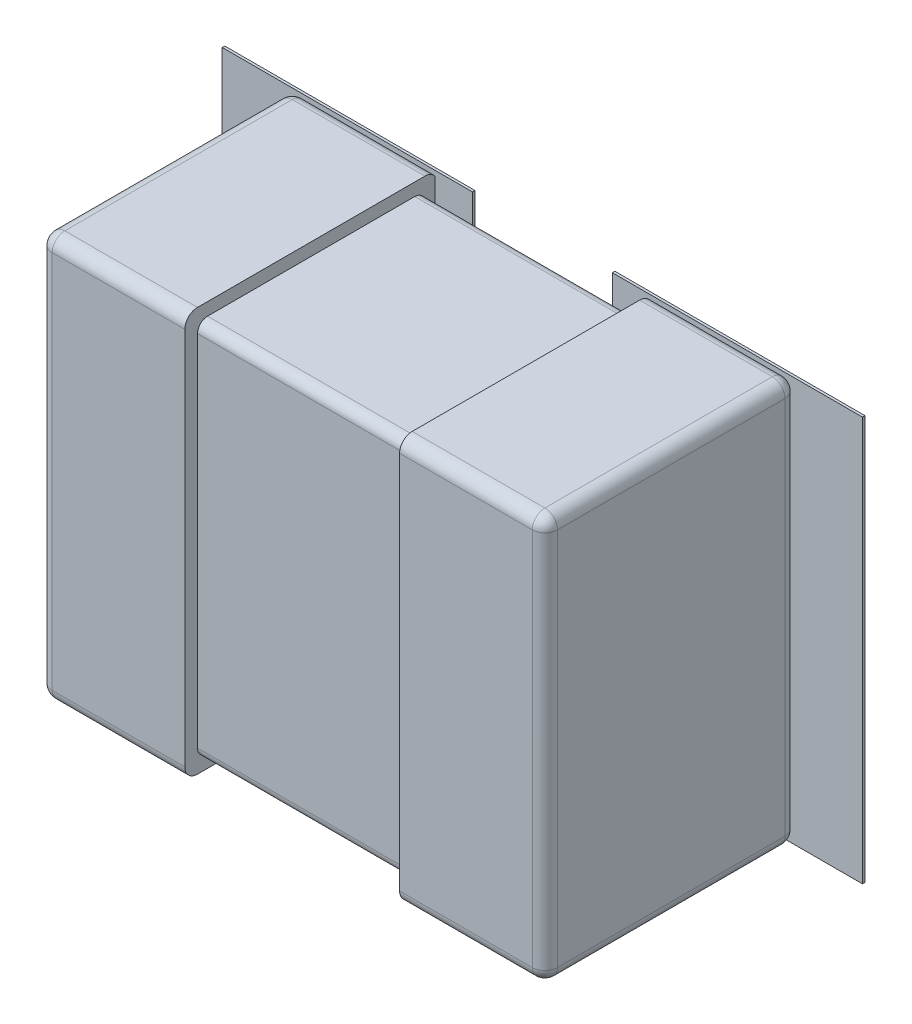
ISO-10303-21;
HEADER;
FILE_DESCRIPTION(('STEP AP214'),'2;1');
FILE_NAME('part.step','',(''),(''),'','','');
FILE_SCHEMA(('AUTOMOTIVE_DESIGN { 1 0 10303 214 1 1 1 1 }'));
ENDSEC;
DATA;
#1=APPLICATION_CONTEXT('core data for automotive mechanical design processes');
#2=APPLICATION_PROTOCOL_DEFINITION('international standard','automotive_design',2000,#1);
#3=PRODUCT_CONTEXT('',#1,'mechanical');
#4=PRODUCT('Part','Part','',(#3));
#5=PRODUCT_RELATED_PRODUCT_CATEGORY('part','',(#4));
#6=PRODUCT_DEFINITION_FORMATION('','',#4);
#7=PRODUCT_DEFINITION_CONTEXT('part definition',#1,'design');
#8=PRODUCT_DEFINITION('design','',#6,#7);
#9=PRODUCT_DEFINITION_SHAPE('','',#8);
#10=(LENGTH_UNIT() NAMED_UNIT(*) SI_UNIT(.MILLI.,.METRE.));
#11=(NAMED_UNIT(*) PLANE_ANGLE_UNIT() SI_UNIT($,.RADIAN.));
#12=(NAMED_UNIT(*) SI_UNIT($,.STERADIAN.) SOLID_ANGLE_UNIT());
#13=UNCERTAINTY_MEASURE_WITH_UNIT(LENGTH_MEASURE(1.E-05),#10,'distance_accuracy_value','');
#14=(GEOMETRIC_REPRESENTATION_CONTEXT(3) GLOBAL_UNCERTAINTY_ASSIGNED_CONTEXT((#13)) GLOBAL_UNIT_ASSIGNED_CONTEXT((#10,
#11,#12)) REPRESENTATION_CONTEXT('',''));
#15=CARTESIAN_POINT('',(0.,0.,0.));
#16=DIRECTION('',(0.,0.,1.));
#17=DIRECTION('',(1.,0.,0.));
#18=AXIS2_PLACEMENT_3D('',#15,#16,#17);
#19=CARTESIAN_POINT('',(0.,0.,0.0762));
#20=DIRECTION('',(0.,0.,1.));
#21=DIRECTION('',(1.,0.,0.));
#22=AXIS2_PLACEMENT_3D('',#19,#20,#21);
#23=PLANE('',#22);
#24=DIRECTION('',(0.,1.,0.));
#25=VECTOR('',#24,1.);
#26=CARTESIAN_POINT('',(0.276999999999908,0.800000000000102,0.0762));
#27=LINE('',#26,#25);
#28=CARTESIAN_POINT('',(0.276999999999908,0.800000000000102,0.0762));
#29=VERTEX_POINT('',#28);
#30=CARTESIAN_POINT('',(0.276999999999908,-0.800000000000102,0.0762));
#31=VERTEX_POINT('',#30);
#32=EDGE_CURVE('E381',#29,#31,#27,.F.);
#33=ORIENTED_EDGE('',*,*,#32,.F.);
#34=DIRECTION('',(1.,0.,0.));
#35=VECTOR('',#34,1.);
#36=CARTESIAN_POINT('',(1.26700000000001,0.800000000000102,0.0762));
#37=LINE('',#36,#35);
#38=CARTESIAN_POINT('',(1.26700000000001,0.800000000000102,0.0762));
#39=VERTEX_POINT('',#38);
#40=EDGE_CURVE('E386',#39,#29,#37,.F.);
#41=ORIENTED_EDGE('',*,*,#40,.F.);
#42=DIRECTION('',(0.,1.,0.));
#43=VECTOR('',#42,1.);
#44=CARTESIAN_POINT('',(1.26700000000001,-0.800000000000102,0.0762));
#45=LINE('',#44,#43);
#46=CARTESIAN_POINT('',(1.26700000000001,-0.800000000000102,0.0762));
#47=VERTEX_POINT('',#46);
#48=EDGE_CURVE('E370',#47,#39,#45,.T.);
#49=ORIENTED_EDGE('',*,*,#48,.F.);
#50=DIRECTION('',(1.,0.,0.));
#51=VECTOR('',#50,1.);
#52=CARTESIAN_POINT('',(0.276999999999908,-0.800000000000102,0.0762));
#53=LINE('',#52,#51);
#54=EDGE_CURVE('E62',#31,#47,#53,.T.);
#55=ORIENTED_EDGE('',*,*,#54,.F.);
#56=EDGE_LOOP('',(#33,#41,#49,#55));
#57=FACE_BOUND('',#56,.T.);
#58=ADVANCED_FACE('F16',(#57),#23,.F.);
#59=CARTESIAN_POINT('',(1.00000000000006,-0.800000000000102,0.0762));
#60=DIRECTION('',(1.,0.,0.));
#61=DIRECTION('',(0.,0.,-1.));
#62=AXIS2_PLACEMENT_3D('',#59,#60,#61);
#63=PLANE('',#62);
#64=DIRECTION('',(0.,0.,-1.));
#65=VECTOR('',#64,1.);
#66=CARTESIAN_POINT('',(1.00000000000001,-0.750000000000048,2.3797953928));
#67=LINE('',#66,#65);
#68=CARTESIAN_POINT('',(1.00000000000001,-0.750000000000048,0.126200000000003));
#69=VERTEX_POINT('',#68);
#70=CARTESIAN_POINT('',(1.00000000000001,-0.750000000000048,1.02619799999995));
#71=VERTEX_POINT('',#70);
#72=EDGE_CURVE('E388',#69,#71,#67,.F.);
#73=ORIENTED_EDGE('',*,*,#72,.F.);
#74=DIRECTION('',(0.,-1.,0.));
#75=VECTOR('',#74,1.);
#76=CARTESIAN_POINT('',(1.00000000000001,3.24647999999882,0.126200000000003));
#77=LINE('',#76,#75);
#78=CARTESIAN_POINT('',(1.00000000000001,0.750000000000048,0.126200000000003));
#79=VERTEX_POINT('',#78);
#80=EDGE_CURVE('E53',#79,#69,#77,.T.);
#81=ORIENTED_EDGE('',*,*,#80,.F.);
#82=DIRECTION('',(0.,0.,-1.));
#83=VECTOR('',#82,1.);
#84=CARTESIAN_POINT('',(1.00000000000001,0.750000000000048,2.3797953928));
#85=LINE('',#84,#83);
#86=CARTESIAN_POINT('',(1.00000000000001,0.750000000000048,1.02619799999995));
#87=VERTEX_POINT('',#86);
#88=EDGE_CURVE('E397',#87,#79,#85,.T.);
#89=ORIENTED_EDGE('',*,*,#88,.F.);
#90=DIRECTION('',(0.,1.,0.));
#91=VECTOR('',#90,1.);
#92=CARTESIAN_POINT('',(1.00000000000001,-3.24647999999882,1.02619799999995));
#93=LINE('',#92,#91);
#94=EDGE_CURVE('E394',#71,#87,#93,.T.);
#95=ORIENTED_EDGE('',*,*,#94,.F.);
#96=EDGE_LOOP('',(#73,#81,#89,#95));
#97=FACE_BOUND('',#96,.T.);
#98=ADVANCED_FACE('F811',(#97),#63,.T.);
#99=CARTESIAN_POINT('',(1.26700000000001,0.800000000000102,0.0762));
#100=DIRECTION('',(0.,1.,0.));
#101=DIRECTION('',(0.,0.,1.));
#102=AXIS2_PLACEMENT_3D('',#99,#100,#101);
#103=PLANE('',#102);
#104=DIRECTION('',(0.,0.,-1.));
#105=VECTOR('',#104,1.);
#106=CARTESIAN_POINT('',(1.26700000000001,0.800000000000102,0.0762));
#107=LINE('',#106,#105);
#108=CARTESIAN_POINT('',(1.26700000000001,0.800000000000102,0.0862000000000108));
#109=VERTEX_POINT('',#108);
#110=EDGE_CURVE('E375',#39,#109,#107,.F.);
#111=ORIENTED_EDGE('',*,*,#110,.F.);
#112=ORIENTED_EDGE('',*,*,#40,.T.);
#113=DIRECTION('',(0.,0.,1.));
#114=VECTOR('',#113,1.);
#115=CARTESIAN_POINT('',(0.276999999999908,0.800000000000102,0.0762));
#116=LINE('',#115,#114);
#117=CARTESIAN_POINT('',(0.276999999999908,0.800000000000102,0.0862000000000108));
#118=VERTEX_POINT('',#117);
#119=EDGE_CURVE('E383',#118,#29,#116,.F.);
#120=ORIENTED_EDGE('',*,*,#119,.F.);
#121=DIRECTION('',(1.,0.,0.));
#122=VECTOR('',#121,1.);
#123=CARTESIAN_POINT('',(0.,0.800000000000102,0.0862000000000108));
#124=LINE('',#123,#122);
#125=EDGE_CURVE('E319',#109,#118,#124,.F.);
#126=ORIENTED_EDGE('',*,*,#125,.F.);
#127=EDGE_LOOP('',(#111,#112,#120,#126));
#128=FACE_BOUND('',#127,.T.);
#129=ADVANCED_FACE('F827',(#128),#103,.T.);
#130=CARTESIAN_POINT('',(0.276999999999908,0.800000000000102,0.0762));
#131=DIRECTION('',(-1.,0.,0.));
#132=DIRECTION('',(0.,0.,1.));
#133=AXIS2_PLACEMENT_3D('',#130,#131,#132);
#134=PLANE('',#133);
#135=ORIENTED_EDGE('',*,*,#119,.T.);
#136=ORIENTED_EDGE('',*,*,#32,.T.);
#137=DIRECTION('',(0.,0.,-1.));
#138=VECTOR('',#137,1.);
#139=CARTESIAN_POINT('',(0.276999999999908,-0.800000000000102,0.0762));
#140=LINE('',#139,#138);
#141=CARTESIAN_POINT('',(0.276999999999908,-0.800000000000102,0.0862000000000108));
#142=VERTEX_POINT('',#141);
#143=EDGE_CURVE('E379',#142,#31,#140,.T.);
#144=ORIENTED_EDGE('',*,*,#143,.F.);
#145=DIRECTION('',(0.,1.,0.));
#146=VECTOR('',#145,1.);
#147=CARTESIAN_POINT('',(0.276999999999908,0.,0.0862000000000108));
#148=LINE('',#147,#146);
#149=EDGE_CURVE('E316',#118,#142,#148,.F.);
#150=ORIENTED_EDGE('',*,*,#149,.F.);
#151=EDGE_LOOP('',(#135,#136,#144,#150));
#152=FACE_BOUND('',#151,.T.);
#153=ADVANCED_FACE('F830',(#152),#134,.T.);
#154=CARTESIAN_POINT('',(0.276999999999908,-0.800000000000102,0.0762));
#155=DIRECTION('',(0.,-1.,0.));
#156=DIRECTION('',(0.,0.,-1.));
#157=AXIS2_PLACEMENT_3D('',#154,#155,#156);
#158=PLANE('',#157);
#159=ORIENTED_EDGE('',*,*,#143,.T.);
#160=ORIENTED_EDGE('',*,*,#54,.T.);
#161=DIRECTION('',(0.,0.,-1.));
#162=VECTOR('',#161,1.);
#163=CARTESIAN_POINT('',(1.26700000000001,-0.800000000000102,0.0762));
#164=LINE('',#163,#162);
#165=CARTESIAN_POINT('',(1.26700000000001,-0.800000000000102,0.0862000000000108));
#166=VERTEX_POINT('',#165);
#167=EDGE_CURVE('E373',#166,#47,#164,.T.);
#168=ORIENTED_EDGE('',*,*,#167,.F.);
#169=DIRECTION('',(1.,0.,0.));
#170=VECTOR('',#169,1.);
#171=CARTESIAN_POINT('',(0.,-0.800000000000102,0.0862000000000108));
#172=LINE('',#171,#170);
#173=EDGE_CURVE('E313',#142,#166,#172,.T.);
#174=ORIENTED_EDGE('',*,*,#173,.F.);
#175=EDGE_LOOP('',(#159,#160,#168,#174));
#176=FACE_BOUND('',#175,.T.);
#177=ADVANCED_FACE('F831',(#176),#158,.T.);
#178=CARTESIAN_POINT('',(1.26700000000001,-0.800000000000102,0.0762));
#179=DIRECTION('',(1.,0.,0.));
#180=DIRECTION('',(0.,0.,-1.));
#181=AXIS2_PLACEMENT_3D('',#178,#179,#180);
#182=PLANE('',#181);
#183=ORIENTED_EDGE('',*,*,#167,.T.);
#184=ORIENTED_EDGE('',*,*,#48,.T.);
#185=ORIENTED_EDGE('',*,*,#110,.T.);
#186=DIRECTION('',(0.,1.,0.));
#187=VECTOR('',#186,1.);
#188=CARTESIAN_POINT('',(1.26700000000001,0.,0.0862000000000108));
#189=LINE('',#188,#187);
#190=EDGE_CURVE('E310',#166,#109,#189,.T.);
#191=ORIENTED_EDGE('',*,*,#190,.F.);
#192=EDGE_LOOP('',(#183,#184,#185,#191));
#193=FACE_BOUND('',#192,.T.);
#194=ADVANCED_FACE('F833',(#193),#182,.T.);
#195=CARTESIAN_POINT('',(0.95000000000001,3.24647999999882,0.126200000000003));
#196=DIRECTION('',(0.,-1.,0.));
#197=DIRECTION('',(0.,0.,-1.));
#198=AXIS2_PLACEMENT_3D('',#195,#196,#197);
#199=CYLINDRICAL_SURFACE('',#198,0.0500000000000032);
#200=CARTESIAN_POINT('',(0.95000000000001,-0.750000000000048,0.126200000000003));
#201=DIRECTION('',(0.,-1.,0.));
#202=DIRECTION('',(0.,0.,-1.));
#203=AXIS2_PLACEMENT_3D('',#200,#201,#202);
#204=CIRCLE('',#203,0.0500000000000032);
#205=CARTESIAN_POINT('',(0.979999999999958,-0.750000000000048,0.0862000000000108));
#206=VERTEX_POINT('',#205);
#207=EDGE_CURVE('E391',#206,#69,#204,.T.);
#208=ORIENTED_EDGE('',*,*,#207,.F.);
#209=DIRECTION('',(0.,1.,0.));
#210=VECTOR('',#209,1.);
#211=CARTESIAN_POINT('',(0.97999999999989,0.,0.0862000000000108));
#212=LINE('',#211,#210);
#213=CARTESIAN_POINT('',(0.979999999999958,0.750000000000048,0.0862000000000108));
#214=VERTEX_POINT('',#213);
#215=EDGE_CURVE('E306',#214,#206,#212,.F.);
#216=ORIENTED_EDGE('',*,*,#215,.F.);
#217=CARTESIAN_POINT('',(0.95000000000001,0.750000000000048,0.126200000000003));
#218=DIRECTION('',(0.,-1.,0.));
#219=DIRECTION('',(0.,0.,-1.));
#220=AXIS2_PLACEMENT_3D('',#217,#218,#219);
#221=CIRCLE('',#220,0.0500000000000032);
#222=EDGE_CURVE('E19',#79,#214,#221,.F.);
#223=ORIENTED_EDGE('',*,*,#222,.F.);
#224=ORIENTED_EDGE('',*,*,#80,.T.);
#225=EDGE_LOOP('',(#208,#216,#223,#224));
#226=FACE_BOUND('',#225,.T.);
#227=ADVANCED_FACE('F362',(#226),#199,.T.);
#228=CARTESIAN_POINT('',(0.95000000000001,0.750000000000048,0.126200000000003));
#229=DIRECTION('',(0.707106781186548,0.707106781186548,0.));
#230=DIRECTION('',(0.,0.,-1.));
#231=AXIS2_PLACEMENT_3D('',#228,#229,#230);
#232=SPHERICAL_SURFACE('',#231,0.0500000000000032);
#233=ORIENTED_EDGE('',*,*,#222,.T.);
#234=CARTESIAN_POINT('',(0.95000000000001,0.780000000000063,0.0862000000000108));
#235=CARTESIAN_POINT('',(0.95338144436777,0.78002230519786,0.0862000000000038));
#236=CARTESIAN_POINT('',(0.956749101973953,0.779431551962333,0.0862000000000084));
#237=CARTESIAN_POINT('',(0.963111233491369,0.77718617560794,0.0862000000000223));
#238=CARTESIAN_POINT('',(0.966105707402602,0.775531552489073,0.0862000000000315));
#239=CARTESIAN_POINT('',(0.97137586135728,0.77132068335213,0.0862000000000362));
#240=CARTESIAN_POINT('',(0.973651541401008,0.768764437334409,0.0862000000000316));
#241=CARTESIAN_POINT('',(0.977225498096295,0.763040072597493,0.0862000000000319));
#242=CARTESIAN_POINT('',(0.978523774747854,0.759871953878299,0.0862000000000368));
#243=CARTESIAN_POINT('',(0.979757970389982,0.754423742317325,0.0862000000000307));
#244=CARTESIAN_POINT('',(0.980008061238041,0.752210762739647,0.0862000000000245));
#245=CARTESIAN_POINT('',(0.980000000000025,0.750000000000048,0.0862000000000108));
#246=B_SPLINE_CURVE_WITH_KNOTS('',3,(#234,#235,#236,#237,#238,#239,#240,#241,#242,#243,#244,
#245),.UNSPECIFIED.,.F.,.F.,(4,2,2,2,2,4),(0.,0.0100731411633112,0.0201462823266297,
0.0302194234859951,0.0402925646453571,0.0469186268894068),.UNSPECIFIED.);
#247=CARTESIAN_POINT('',(0.95000000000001,0.78000000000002,0.0861999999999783));
#248=VERTEX_POINT('',#247);
#249=EDGE_CURVE('E309',#248,#214,#246,.T.);
#250=ORIENTED_EDGE('',*,*,#249,.F.);
#251=CARTESIAN_POINT('',(0.95000000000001,0.750000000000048,0.126200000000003));
#252=DIRECTION('',(1.,0.,0.));
#253=DIRECTION('',(0.,0.,-1.));
#254=AXIS2_PLACEMENT_3D('',#251,#252,#253);
#255=CIRCLE('',#254,0.0500000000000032);
#256=CARTESIAN_POINT('',(0.95000000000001,0.800000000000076,0.126200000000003));
#257=VERTEX_POINT('',#256);
#258=EDGE_CURVE('E305',#257,#248,#255,.F.);
#259=ORIENTED_EDGE('',*,*,#258,.F.);
#260=CARTESIAN_POINT('',(0.95000000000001,0.750000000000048,0.126200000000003));
#261=DIRECTION('',(0.,0.,-1.));
#262=DIRECTION('',(-1.,0.,0.));
#263=AXIS2_PLACEMENT_3D('',#260,#261,#262);
#264=CIRCLE('',#263,0.0500000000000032);
#265=CARTESIAN_POINT('',(0.985355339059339,0.785355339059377,0.126200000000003));
#266=VERTEX_POINT('',#265);
#267=EDGE_CURVE('E272',#266,#257,#264,.F.);
#268=ORIENTED_EDGE('',*,*,#267,.F.);
#269=CARTESIAN_POINT('',(0.95000000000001,0.750000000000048,0.126200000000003));
#270=DIRECTION('',(0.,0.,-1.));
#271=DIRECTION('',(-1.,0.,0.));
#272=AXIS2_PLACEMENT_3D('',#269,#270,#271);
#273=CIRCLE('',#272,0.0500000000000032);
#274=EDGE_CURVE('E34',#79,#266,#273,.F.);
#275=ORIENTED_EDGE('',*,*,#274,.F.);
#276=EDGE_LOOP('',(#233,#250,#259,#268,#275));
#277=FACE_BOUND('',#276,.T.);
#278=ADVANCED_FACE('F356',(#277),#232,.T.);
#279=CARTESIAN_POINT('',(0.95000000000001,0.750000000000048,2.3797953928));
#280=DIRECTION('',(0.,0.,-1.));
#281=DIRECTION('',(-1.,0.,0.));
#282=AXIS2_PLACEMENT_3D('',#279,#280,#281);
#283=CYLINDRICAL_SURFACE('',#282,0.0500000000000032);
#284=ORIENTED_EDGE('',*,*,#267,.T.);
#285=DIRECTION('',(0.,0.,1.));
#286=VECTOR('',#285,1.);
#287=CARTESIAN_POINT('',(0.95000000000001,0.800000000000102,0.0762));
#288=LINE('',#287,#286);
#289=CARTESIAN_POINT('',(0.95000000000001,0.800000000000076,1.02619799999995));
#290=VERTEX_POINT('',#289);
#291=EDGE_CURVE('E284',#290,#257,#288,.F.);
#292=ORIENTED_EDGE('',*,*,#291,.F.);
#293=CARTESIAN_POINT('',(0.95000000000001,0.750000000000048,1.02619799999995));
#294=DIRECTION('',(0.,0.,-1.));
#295=DIRECTION('',(-1.,0.,0.));
#296=AXIS2_PLACEMENT_3D('',#293,#294,#295);
#297=CIRCLE('',#296,0.0500000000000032);
#298=EDGE_CURVE('E267',#87,#290,#297,.F.);
#299=ORIENTED_EDGE('',*,*,#298,.F.);
#300=ORIENTED_EDGE('',*,*,#88,.T.);
#301=ORIENTED_EDGE('',*,*,#274,.T.);
#302=EDGE_LOOP('',(#284,#292,#299,#300,#301));
#303=FACE_BOUND('',#302,.T.);
#304=ADVANCED_FACE('F285',(#303),#283,.T.);
#305=CARTESIAN_POINT('',(0.95000000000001,0.750000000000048,1.02619799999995));
#306=DIRECTION('',(0.,0.707106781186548,0.707106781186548));
#307=DIRECTION('',(1.,0.,0.));
#308=AXIS2_PLACEMENT_3D('',#305,#306,#307);
#309=SPHERICAL_SURFACE('',#308,0.0500000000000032);
#310=CARTESIAN_POINT('',(0.95000000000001,0.750000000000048,1.02619799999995));
#311=DIRECTION('',(0.,1.,0.));
#312=DIRECTION('',(0.,0.,1.));
#313=AXIS2_PLACEMENT_3D('',#310,#311,#312);
#314=CIRCLE('',#313,0.0500000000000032);
#315=CARTESIAN_POINT('',(0.95000000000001,0.750000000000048,1.07619799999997));
#316=VERTEX_POINT('',#315);
#317=EDGE_CURVE('E261',#87,#316,#314,.F.);
#318=ORIENTED_EDGE('',*,*,#317,.F.);
#319=ORIENTED_EDGE('',*,*,#298,.T.);
#320=CARTESIAN_POINT('',(0.95000000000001,0.750000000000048,1.02619799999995));
#321=DIRECTION('',(-1.,0.,0.));
#322=DIRECTION('',(0.,0.,1.));
#323=AXIS2_PLACEMENT_3D('',#320,#321,#322);
#324=CIRCLE('',#323,0.0500000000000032);
#325=CARTESIAN_POINT('',(0.95000000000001,0.785355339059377,1.06155333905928));
#326=VERTEX_POINT('',#325);
#327=EDGE_CURVE('E270',#326,#290,#324,.T.);
#328=ORIENTED_EDGE('',*,*,#327,.F.);
#329=CARTESIAN_POINT('',(0.95000000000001,0.750000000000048,1.02619799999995));
#330=DIRECTION('',(-1.,0.,0.));
#331=DIRECTION('',(0.,0.,1.));
#332=AXIS2_PLACEMENT_3D('',#329,#330,#331);
#333=CIRCLE('',#332,0.0500000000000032);
#334=EDGE_CURVE('E281',#316,#326,#333,.T.);
#335=ORIENTED_EDGE('',*,*,#334,.F.);
#336=EDGE_LOOP('',(#318,#319,#328,#335));
#337=FACE_BOUND('',#336,.T.);
#338=ADVANCED_FACE('F269',(#337),#309,.T.);
#339=CARTESIAN_POINT('',(0.95000000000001,-3.24647999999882,1.02619799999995));
#340=DIRECTION('',(0.,1.,0.));
#341=DIRECTION('',(0.,0.,1.));
#342=AXIS2_PLACEMENT_3D('',#339,#340,#341);
#343=CYLINDRICAL_SURFACE('',#342,0.0500000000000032);
#344=CARTESIAN_POINT('',(0.95000000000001,-0.750000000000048,1.02619799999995));
#345=DIRECTION('',(0.,1.,0.));
#346=DIRECTION('',(0.,0.,1.));
#347=AXIS2_PLACEMENT_3D('',#344,#345,#346);
#348=CIRCLE('',#347,0.0500000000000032);
#349=CARTESIAN_POINT('',(0.985355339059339,-0.750000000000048,1.06155333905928));
#350=VERTEX_POINT('',#349);
#351=EDGE_CURVE('E396',#71,#350,#348,.F.);
#352=ORIENTED_EDGE('',*,*,#351,.F.);
#353=ORIENTED_EDGE('',*,*,#94,.T.);
#354=ORIENTED_EDGE('',*,*,#317,.T.);
#355=DIRECTION('',(0.,1.,0.));
#356=VECTOR('',#355,1.);
#357=CARTESIAN_POINT('',(0.95000000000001,0.,1.076198));
#358=LINE('',#357,#356);
#359=CARTESIAN_POINT('',(0.95000000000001,-0.750000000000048,1.07619799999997));
#360=VERTEX_POINT('',#359);
#361=EDGE_CURVE('E295',#360,#316,#358,.T.);
#362=ORIENTED_EDGE('',*,*,#361,.F.);
#363=CARTESIAN_POINT('',(0.95000000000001,-0.750000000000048,1.02619799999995));
#364=DIRECTION('',(0.,-1.,0.));
#365=DIRECTION('',(0.707106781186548,0.,0.707106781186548));
#366=AXIS2_PLACEMENT_3D('',#363,#364,#365);
#367=CIRCLE('',#366,0.0500000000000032);
#368=EDGE_CURVE('E786',#350,#360,#367,.T.);
#369=ORIENTED_EDGE('',*,*,#368,.F.);
#370=EDGE_LOOP('',(#352,#353,#354,#362,#369));
#371=FACE_BOUND('',#370,.T.);
#372=ADVANCED_FACE('F797',(#371),#343,.T.);
#373=CARTESIAN_POINT('',(0.95000000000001,-0.750000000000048,1.02619799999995));
#374=DIRECTION('',(0.707106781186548,0.,0.707106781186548));
#375=DIRECTION('',(0.,-1.,0.));
#376=AXIS2_PLACEMENT_3D('',#373,#374,#375);
#377=SPHERICAL_SURFACE('',#376,0.0500000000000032);
#378=ORIENTED_EDGE('',*,*,#351,.T.);
#379=ORIENTED_EDGE('',*,*,#368,.T.);
#380=CARTESIAN_POINT('',(0.95000000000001,-0.750000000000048,1.02619799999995));
#381=DIRECTION('',(1.,0.,0.));
#382=DIRECTION('',(0.,0.,-1.));
#383=AXIS2_PLACEMENT_3D('',#380,#381,#382);
#384=CIRCLE('',#383,0.0500000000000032);
#385=CARTESIAN_POINT('',(0.95000000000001,-0.800000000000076,1.02619799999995));
#386=VERTEX_POINT('',#385);
#387=EDGE_CURVE('E769',#386,#360,#384,.F.);
#388=ORIENTED_EDGE('',*,*,#387,.F.);
#389=CARTESIAN_POINT('',(0.95000000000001,-0.750000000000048,1.02619799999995));
#390=DIRECTION('',(0.,0.,-1.));
#391=DIRECTION('',(-1.,0.,0.));
#392=AXIS2_PLACEMENT_3D('',#389,#390,#391);
#393=CIRCLE('',#392,0.0500000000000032);
#394=EDGE_CURVE('E392',#71,#386,#393,.T.);
#395=ORIENTED_EDGE('',*,*,#394,.F.);
#396=EDGE_LOOP('',(#378,#379,#388,#395));
#397=FACE_BOUND('',#396,.T.);
#398=ADVANCED_FACE('F784',(#397),#377,.T.);
#399=CARTESIAN_POINT('',(0.95000000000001,-0.750000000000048,2.3797953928));
#400=DIRECTION('',(0.,0.,-1.));
#401=DIRECTION('',(-1.,0.,0.));
#402=AXIS2_PLACEMENT_3D('',#399,#400,#401);
#403=CYLINDRICAL_SURFACE('',#402,0.0500000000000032);
#404=CARTESIAN_POINT('',(0.95000000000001,-0.750000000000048,0.126200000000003));
#405=DIRECTION('',(0.,0.,-1.));
#406=DIRECTION('',(-1.,0.,0.));
#407=AXIS2_PLACEMENT_3D('',#404,#405,#406);
#408=CIRCLE('',#407,0.0500000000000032);
#409=CARTESIAN_POINT('',(0.985355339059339,-0.785355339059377,0.126200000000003));
#410=VERTEX_POINT('',#409);
#411=EDGE_CURVE('E354',#69,#410,#408,.T.);
#412=ORIENTED_EDGE('',*,*,#411,.F.);
#413=ORIENTED_EDGE('',*,*,#72,.T.);
#414=ORIENTED_EDGE('',*,*,#394,.T.);
#415=DIRECTION('',(0.,0.,-1.));
#416=VECTOR('',#415,1.);
#417=CARTESIAN_POINT('',(0.95000000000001,-0.800000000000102,0.0762));
#418=LINE('',#417,#416);
#419=CARTESIAN_POINT('',(0.95000000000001,-0.800000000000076,0.126200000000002));
#420=VERTEX_POINT('',#419);
#421=EDGE_CURVE('E323',#420,#386,#418,.F.);
#422=ORIENTED_EDGE('',*,*,#421,.F.);
#423=CARTESIAN_POINT('',(0.95000000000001,-0.750000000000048,0.126200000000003));
#424=DIRECTION('',(0.,0.,-1.));
#425=DIRECTION('',(0.707106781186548,-0.707106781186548,0.));
#426=AXIS2_PLACEMENT_3D('',#423,#424,#425);
#427=CIRCLE('',#426,0.0500000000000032);
#428=EDGE_CURVE('E322',#410,#420,#427,.T.);
#429=ORIENTED_EDGE('',*,*,#428,.F.);
#430=EDGE_LOOP('',(#412,#413,#414,#422,#429));
#431=FACE_BOUND('',#430,.T.);
#432=ADVANCED_FACE('F337',(#431),#403,.T.);
#433=CARTESIAN_POINT('',(0.95000000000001,-0.750000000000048,0.126200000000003));
#434=DIRECTION('',(0.707106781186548,-0.707106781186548,0.));
#435=DIRECTION('',(0.,0.,-1.));
#436=AXIS2_PLACEMENT_3D('',#433,#434,#435);
#437=SPHERICAL_SURFACE('',#436,0.0500000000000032);
#438=CARTESIAN_POINT('',(0.95000000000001,-0.750000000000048,0.126200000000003));
#439=DIRECTION('',(-1.,0.,0.));
#440=DIRECTION('',(0.,0.,1.));
#441=AXIS2_PLACEMENT_3D('',#438,#439,#440);
#442=CIRCLE('',#441,0.0500000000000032);
#443=CARTESIAN_POINT('',(0.95000000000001,-0.78000000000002,0.0861999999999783));
#444=VERTEX_POINT('',#443);
#445=EDGE_CURVE('E765',#444,#420,#442,.T.);
#446=ORIENTED_EDGE('',*,*,#445,.F.);
#447=CARTESIAN_POINT('',(0.980000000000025,-0.750000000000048,0.0862000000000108));
#448=CARTESIAN_POINT('',(0.980022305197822,-0.753381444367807,0.0862000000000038));
#449=CARTESIAN_POINT('',(0.979431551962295,-0.75674910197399,0.0862000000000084));
#450=CARTESIAN_POINT('',(0.977186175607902,-0.763111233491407,0.0862000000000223));
#451=CARTESIAN_POINT('',(0.975531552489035,-0.76610570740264,0.0862000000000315));
#452=CARTESIAN_POINT('',(0.971320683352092,-0.771375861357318,0.0862000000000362));
#453=CARTESIAN_POINT('',(0.968764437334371,-0.773651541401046,0.0862000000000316));
#454=CARTESIAN_POINT('',(0.963040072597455,-0.777225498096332,0.0862000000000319));
#455=CARTESIAN_POINT('',(0.959871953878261,-0.778523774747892,0.0862000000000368));
#456=CARTESIAN_POINT('',(0.954423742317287,-0.77975797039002,0.0862000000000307));
#457=CARTESIAN_POINT('',(0.952210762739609,-0.780008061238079,0.0862000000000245));
#458=CARTESIAN_POINT('',(0.95000000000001,-0.780000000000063,0.0862000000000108));
#459=B_SPLINE_CURVE_WITH_KNOTS('',3,(#447,#448,#449,#450,#451,#452,#453,#454,#455,#456,#457,
#458),.UNSPECIFIED.,.F.,.F.,(4,2,2,2,2,4),(0.,0.0100731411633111,0.0201462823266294,
0.0302194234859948,0.040292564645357,0.0469186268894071),.UNSPECIFIED.);
#460=EDGE_CURVE('E308',#206,#444,#459,.T.);
#461=ORIENTED_EDGE('',*,*,#460,.F.);
#462=ORIENTED_EDGE('',*,*,#207,.T.);
#463=ORIENTED_EDGE('',*,*,#411,.T.);
#464=ORIENTED_EDGE('',*,*,#428,.T.);
#465=EDGE_LOOP('',(#446,#461,#462,#463,#464));
#466=FACE_BOUND('',#465,.T.);
#467=ADVANCED_FACE('F331',(#466),#437,.T.);
#468=CARTESIAN_POINT('',(0.,0.,0.0862000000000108));
#469=DIRECTION('',(0.,0.,1.));
#470=DIRECTION('',(1.,0.,0.));
#471=AXIS2_PLACEMENT_3D('',#468,#469,#470);
#472=PLANE('',#471);
#473=DIRECTION('',(-1.,0.,0.));
#474=VECTOR('',#473,1.);
#475=CARTESIAN_POINT('',(4.57032239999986,-0.779999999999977,0.0861999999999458));
#476=LINE('',#475,#474);
#477=CARTESIAN_POINT('',(0.425000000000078,-0.78000000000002,0.0861999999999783));
#478=VERTEX_POINT('',#477);
#479=EDGE_CURVE('E694',#478,#444,#476,.F.);
#480=ORIENTED_EDGE('',*,*,#479,.F.);
#481=DIRECTION('',(0.,1.,0.));
#482=VECTOR('',#481,1.);
#483=CARTESIAN_POINT('',(0.425000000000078,-0.800000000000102,0.0862000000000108));
#484=LINE('',#483,#482);
#485=CARTESIAN_POINT('',(0.425000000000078,0.78000000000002,0.0861999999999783));
#486=VERTEX_POINT('',#485);
#487=EDGE_CURVE('E692',#478,#486,#484,.T.);
#488=ORIENTED_EDGE('',*,*,#487,.T.);
#489=DIRECTION('',(1.,0.,0.));
#490=VECTOR('',#489,1.);
#491=CARTESIAN_POINT('',(-4.57032239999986,0.779999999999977,0.0861999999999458));
#492=LINE('',#491,#490);
#493=EDGE_CURVE('E289',#248,#486,#492,.F.);
#494=ORIENTED_EDGE('',*,*,#493,.F.);
#495=ORIENTED_EDGE('',*,*,#249,.T.);
#496=ORIENTED_EDGE('',*,*,#215,.T.);
#497=ORIENTED_EDGE('',*,*,#460,.T.);
#498=EDGE_LOOP('',(#480,#488,#494,#495,#496,#497));
#499=FACE_BOUND('',#498,.T.);
#500=ORIENTED_EDGE('',*,*,#173,.T.);
#501=ORIENTED_EDGE('',*,*,#190,.T.);
#502=ORIENTED_EDGE('',*,*,#125,.T.);
#503=ORIENTED_EDGE('',*,*,#149,.T.);
#504=EDGE_LOOP('',(#500,#501,#502,#503));
#505=FACE_BOUND('',#504,.T.);
#506=ADVANCED_FACE('F336',(#499,#505),#472,.T.);
#507=CARTESIAN_POINT('',(-4.57032239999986,0.750000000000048,0.126200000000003));
#508=DIRECTION('',(1.,0.,0.));
#509=DIRECTION('',(0.,0.,-1.));
#510=AXIS2_PLACEMENT_3D('',#507,#508,#509);
#511=CYLINDRICAL_SURFACE('',#510,0.0500000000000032);
#512=ORIENTED_EDGE('',*,*,#258,.T.);
#513=ORIENTED_EDGE('',*,*,#493,.T.);
#514=CARTESIAN_POINT('',(0.425000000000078,0.750000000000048,0.126200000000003));
#515=DIRECTION('',(1.,0.,0.));
#516=DIRECTION('',(0.,0.,-1.));
#517=AXIS2_PLACEMENT_3D('',#514,#515,#516);
#518=CIRCLE('',#517,0.0500000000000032);
#519=CARTESIAN_POINT('',(0.425000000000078,0.800000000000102,0.126200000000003));
#520=VERTEX_POINT('',#519);
#521=EDGE_CURVE('E698',#486,#520,#518,.T.);
#522=ORIENTED_EDGE('',*,*,#521,.T.);
#523=DIRECTION('',(1.,0.,0.));
#524=VECTOR('',#523,1.);
#525=CARTESIAN_POINT('',(1.00000000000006,0.800000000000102,0.126200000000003));
#526=LINE('',#525,#524);
#527=EDGE_CURVE('E288',#257,#520,#526,.F.);
#528=ORIENTED_EDGE('',*,*,#527,.F.);
#529=EDGE_LOOP('',(#512,#513,#522,#528));
#530=FACE_BOUND('',#529,.T.);
#531=ADVANCED_FACE('F674',(#530),#511,.T.);
#532=CARTESIAN_POINT('',(1.00000000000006,0.800000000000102,0.0762));
#533=DIRECTION('',(0.,1.,0.));
#534=DIRECTION('',(0.,0.,1.));
#535=AXIS2_PLACEMENT_3D('',#532,#533,#534);
#536=PLANE('',#535);
#537=DIRECTION('',(0.,0.,-1.));
#538=VECTOR('',#537,1.);
#539=CARTESIAN_POINT('',(0.425000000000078,0.800000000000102,0.126200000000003));
#540=LINE('',#539,#538);
#541=CARTESIAN_POINT('',(0.425000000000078,0.800000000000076,1.02619799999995));
#542=VERTEX_POINT('',#541);
#543=EDGE_CURVE('E294',#520,#542,#540,.F.);
#544=ORIENTED_EDGE('',*,*,#543,.T.);
#545=DIRECTION('',(-1.,0.,0.));
#546=VECTOR('',#545,1.);
#547=CARTESIAN_POINT('',(4.57032239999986,0.800000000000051,1.02619799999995));
#548=LINE('',#547,#546);
#549=EDGE_CURVE('E278',#290,#542,#548,.T.);
#550=ORIENTED_EDGE('',*,*,#549,.F.);
#551=ORIENTED_EDGE('',*,*,#291,.T.);
#552=ORIENTED_EDGE('',*,*,#527,.T.);
#553=EDGE_LOOP('',(#544,#550,#551,#552));
#554=FACE_BOUND('',#553,.T.);
#555=ADVANCED_FACE('F292',(#554),#536,.T.);
#556=CARTESIAN_POINT('',(4.57032239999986,0.750000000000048,1.02619799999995));
#557=DIRECTION('',(-1.,0.,0.));
#558=DIRECTION('',(0.,0.,1.));
#559=AXIS2_PLACEMENT_3D('',#556,#557,#558);
#560=CYLINDRICAL_SURFACE('',#559,0.0500000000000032);
#561=ORIENTED_EDGE('',*,*,#549,.T.);
#562=CARTESIAN_POINT('',(0.425000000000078,0.750000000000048,1.02619799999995));
#563=DIRECTION('',(-1.,0.,0.));
#564=DIRECTION('',(0.,0.,1.));
#565=AXIS2_PLACEMENT_3D('',#562,#563,#564);
#566=CIRCLE('',#565,0.0500000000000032);
#567=CARTESIAN_POINT('',(0.425000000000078,0.750000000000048,1.076198));
#568=VERTEX_POINT('',#567);
#569=EDGE_CURVE('E756',#542,#568,#566,.F.);
#570=ORIENTED_EDGE('',*,*,#569,.T.);
#571=DIRECTION('',(1.,0.,0.));
#572=VECTOR('',#571,1.);
#573=CARTESIAN_POINT('',(0.,0.750000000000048,1.076198));
#574=LINE('',#573,#572);
#575=EDGE_CURVE('E298',#316,#568,#574,.F.);
#576=ORIENTED_EDGE('',*,*,#575,.F.);
#577=ORIENTED_EDGE('',*,*,#334,.T.);
#578=ORIENTED_EDGE('',*,*,#327,.T.);
#579=EDGE_LOOP('',(#561,#570,#576,#577,#578));
#580=FACE_BOUND('',#579,.T.);
#581=ADVANCED_FACE('F275',(#580),#560,.T.);
#582=CARTESIAN_POINT('',(0.,0.,1.076198));
#583=DIRECTION('',(0.,0.,1.));
#584=DIRECTION('',(1.,0.,0.));
#585=AXIS2_PLACEMENT_3D('',#582,#583,#584);
#586=PLANE('',#585);
#587=DIRECTION('',(0.,1.,0.));
#588=VECTOR('',#587,1.);
#589=CARTESIAN_POINT('',(0.425000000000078,-0.800000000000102,1.076198));
#590=LINE('',#589,#588);
#591=CARTESIAN_POINT('',(0.425000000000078,-0.750000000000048,1.07619799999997));
#592=VERTEX_POINT('',#591);
#593=EDGE_CURVE('E754',#568,#592,#590,.F.);
#594=ORIENTED_EDGE('',*,*,#593,.T.);
#595=DIRECTION('',(1.,0.,0.));
#596=VECTOR('',#595,1.);
#597=CARTESIAN_POINT('',(-4.57032239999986,-0.750000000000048,1.07619799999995));
#598=LINE('',#597,#596);
#599=EDGE_CURVE('E327',#360,#592,#598,.F.);
#600=ORIENTED_EDGE('',*,*,#599,.F.);
#601=ORIENTED_EDGE('',*,*,#361,.T.);
#602=ORIENTED_EDGE('',*,*,#575,.T.);
#603=EDGE_LOOP('',(#594,#600,#601,#602));
#604=FACE_BOUND('',#603,.T.);
#605=ADVANCED_FACE('F666',(#604),#586,.T.);
#606=CARTESIAN_POINT('',(-4.57032239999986,-0.750000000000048,1.02619799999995));
#607=DIRECTION('',(1.,0.,0.));
#608=DIRECTION('',(0.,0.,-1.));
#609=AXIS2_PLACEMENT_3D('',#606,#607,#608);
#610=CYLINDRICAL_SURFACE('',#609,0.0500000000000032);
#611=ORIENTED_EDGE('',*,*,#599,.T.);
#612=CARTESIAN_POINT('',(0.425000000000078,-0.750000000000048,1.02619799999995));
#613=DIRECTION('',(1.,0.,0.));
#614=DIRECTION('',(0.,0.,-1.));
#615=AXIS2_PLACEMENT_3D('',#612,#613,#614);
#616=CIRCLE('',#615,0.0500000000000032);
#617=CARTESIAN_POINT('',(0.425000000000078,-0.800000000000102,1.02619799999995));
#618=VERTEX_POINT('',#617);
#619=EDGE_CURVE('E753',#592,#618,#616,.T.);
#620=ORIENTED_EDGE('',*,*,#619,.T.);
#621=DIRECTION('',(1.,0.,0.));
#622=VECTOR('',#621,1.);
#623=CARTESIAN_POINT('',(-1.00000000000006,-0.800000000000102,1.02619799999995));
#624=LINE('',#623,#622);
#625=EDGE_CURVE('E326',#386,#618,#624,.F.);
#626=ORIENTED_EDGE('',*,*,#625,.F.);
#627=ORIENTED_EDGE('',*,*,#387,.T.);
#628=EDGE_LOOP('',(#611,#620,#626,#627));
#629=FACE_BOUND('',#628,.T.);
#630=ADVANCED_FACE('F662',(#629),#610,.T.);
#631=CARTESIAN_POINT('',(-1.00000000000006,-0.800000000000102,0.0762));
#632=DIRECTION('',(0.,-1.,0.));
#633=DIRECTION('',(0.,0.,-1.));
#634=AXIS2_PLACEMENT_3D('',#631,#632,#633);
#635=PLANE('',#634);
#636=ORIENTED_EDGE('',*,*,#421,.T.);
#637=ORIENTED_EDGE('',*,*,#625,.T.);
#638=DIRECTION('',(0.,0.,-1.));
#639=VECTOR('',#638,1.);
#640=CARTESIAN_POINT('',(0.425000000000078,-0.800000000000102,0.126200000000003));
#641=LINE('',#640,#639);
#642=CARTESIAN_POINT('',(0.425000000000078,-0.800000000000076,0.126200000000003));
#643=VERTEX_POINT('',#642);
#644=EDGE_CURVE('E750',#618,#643,#641,.T.);
#645=ORIENTED_EDGE('',*,*,#644,.T.);
#646=DIRECTION('',(-1.,0.,0.));
#647=VECTOR('',#646,1.);
#648=CARTESIAN_POINT('',(4.57032239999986,-0.800000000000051,0.126200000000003));
#649=LINE('',#648,#647);
#650=EDGE_CURVE('E768',#420,#643,#649,.T.);
#651=ORIENTED_EDGE('',*,*,#650,.F.);
#652=EDGE_LOOP('',(#636,#637,#645,#651));
#653=FACE_BOUND('',#652,.T.);
#654=ADVANCED_FACE('F658',(#653),#635,.T.);
#655=CARTESIAN_POINT('',(4.57032239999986,-0.750000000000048,0.126200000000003));
#656=DIRECTION('',(-1.,0.,0.));
#657=DIRECTION('',(0.,0.,1.));
#658=AXIS2_PLACEMENT_3D('',#655,#656,#657);
#659=CYLINDRICAL_SURFACE('',#658,0.0500000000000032);
#660=CARTESIAN_POINT('',(0.425000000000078,-0.750000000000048,0.126200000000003));
#661=DIRECTION('',(-1.,0.,0.));
#662=DIRECTION('',(0.,0.,1.));
#663=AXIS2_PLACEMENT_3D('',#660,#661,#662);
#664=CIRCLE('',#663,0.0500000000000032);
#665=EDGE_CURVE('E752',#643,#478,#664,.F.);
#666=ORIENTED_EDGE('',*,*,#665,.T.);
#667=ORIENTED_EDGE('',*,*,#479,.T.);
#668=ORIENTED_EDGE('',*,*,#445,.T.);
#669=ORIENTED_EDGE('',*,*,#650,.T.);
#670=EDGE_LOOP('',(#666,#667,#668,#669));
#671=FACE_BOUND('',#670,.T.);
#672=ADVANCED_FACE('F654',(#671),#659,.T.);
#673=CARTESIAN_POINT('',(-0.95000000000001,-0.750000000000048,1.02619799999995));
#674=DIRECTION('',(0.,-0.707106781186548,0.707106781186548));
#675=DIRECTION('',(-1.,0.,0.));
#676=AXIS2_PLACEMENT_3D('',#673,#674,#675);
#677=SPHERICAL_SURFACE('',#676,0.0500000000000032);
#678=CARTESIAN_POINT('',(-0.95000000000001,-0.750000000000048,1.02619799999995));
#679=DIRECTION('',(1.,0.,0.));
#680=DIRECTION('',(0.,0.,-1.));
#681=AXIS2_PLACEMENT_3D('',#678,#679,#680);
#682=CIRCLE('',#681,0.0500000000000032);
#683=CARTESIAN_POINT('',(-0.95000000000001,-0.785355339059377,1.06155333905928));
#684=VERTEX_POINT('',#683);
#685=CARTESIAN_POINT('',(-0.95000000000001,-0.800000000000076,1.02619799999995));
#686=VERTEX_POINT('',#685);
#687=EDGE_CURVE('E645',#684,#686,#682,.T.);
#688=ORIENTED_EDGE('',*,*,#687,.F.);
#689=CARTESIAN_POINT('',(-0.95000000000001,-0.750000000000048,1.02619799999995));
#690=DIRECTION('',(1.,0.,0.));
#691=DIRECTION('',(0.,0.,-1.));
#692=AXIS2_PLACEMENT_3D('',#689,#690,#691);
#693=CIRCLE('',#692,0.0500000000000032);
#694=CARTESIAN_POINT('',(-0.95000000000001,-0.750000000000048,1.07619799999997));
#695=VERTEX_POINT('',#694);
#696=EDGE_CURVE('E643',#695,#684,#693,.T.);
#697=ORIENTED_EDGE('',*,*,#696,.F.);
#698=CARTESIAN_POINT('',(-0.95000000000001,-0.750000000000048,1.02619799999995));
#699=DIRECTION('',(0.,-1.,0.));
#700=DIRECTION('',(0.,0.,-1.));
#701=AXIS2_PLACEMENT_3D('',#698,#699,#700);
#702=CIRCLE('',#701,0.0500000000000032);
#703=CARTESIAN_POINT('',(-1.00000000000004,-0.750000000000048,1.02619799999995));
#704=VERTEX_POINT('',#703);
#705=EDGE_CURVE('E702',#704,#695,#702,.F.);
#706=ORIENTED_EDGE('',*,*,#705,.F.);
#707=CARTESIAN_POINT('',(-0.95000000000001,-0.750000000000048,1.02619799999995));
#708=DIRECTION('',(0.,0.,-1.));
#709=DIRECTION('',(-1.,0.,0.));
#710=AXIS2_PLACEMENT_3D('',#707,#708,#709);
#711=CIRCLE('',#710,0.0500000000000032);
#712=EDGE_CURVE('E728',#686,#704,#711,.T.);
#713=ORIENTED_EDGE('',*,*,#712,.F.);
#714=EDGE_LOOP('',(#688,#697,#706,#713));
#715=FACE_BOUND('',#714,.T.);
#716=ADVANCED_FACE('F651',(#715),#677,.T.);
#717=CARTESIAN_POINT('',(-0.95000000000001,3.24647999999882,1.02619799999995));
#718=DIRECTION('',(0.,-1.,0.));
#719=DIRECTION('',(0.,0.,-1.));
#720=AXIS2_PLACEMENT_3D('',#717,#718,#719);
#721=CYLINDRICAL_SURFACE('',#720,0.0500000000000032);
#722=CARTESIAN_POINT('',(-0.95000000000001,0.750000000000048,1.02619799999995));
#723=DIRECTION('',(0.,-1.,0.));
#724=DIRECTION('',(0.,0.,-1.));
#725=AXIS2_PLACEMENT_3D('',#722,#723,#724);
#726=CIRCLE('',#725,0.0500000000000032);
#727=CARTESIAN_POINT('',(-1.00000000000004,0.750000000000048,1.02619799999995));
#728=VERTEX_POINT('',#727);
#729=CARTESIAN_POINT('',(-0.95000000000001,0.750000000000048,1.07619799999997));
#730=VERTEX_POINT('',#729);
#731=EDGE_CURVE('E699',#728,#730,#726,.F.);
#732=ORIENTED_EDGE('',*,*,#731,.F.);
#733=DIRECTION('',(0.,1.,0.));
#734=VECTOR('',#733,1.);
#735=CARTESIAN_POINT('',(-1.00000000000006,0.800000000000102,1.02619799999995));
#736=LINE('',#735,#734);
#737=EDGE_CURVE('E649',#704,#728,#736,.T.);
#738=ORIENTED_EDGE('',*,*,#737,.F.);
#739=ORIENTED_EDGE('',*,*,#705,.T.);
#740=DIRECTION('',(0.,1.,0.));
#741=VECTOR('',#740,1.);
#742=CARTESIAN_POINT('',(-0.95000000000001,0.,1.076198));
#743=LINE('',#742,#741);
#744=EDGE_CURVE('E641',#730,#695,#743,.F.);
#745=ORIENTED_EDGE('',*,*,#744,.F.);
#746=EDGE_LOOP('',(#732,#738,#739,#745));
#747=FACE_BOUND('',#746,.T.);
#748=ADVANCED_FACE('F635',(#747),#721,.T.);
#749=CARTESIAN_POINT('',(-0.95000000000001,0.750000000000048,1.02619799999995));
#750=DIRECTION('',(-0.707106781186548,0.707106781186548,0.));
#751=DIRECTION('',(0.,0.,1.));
#752=AXIS2_PLACEMENT_3D('',#749,#750,#751);
#753=SPHERICAL_SURFACE('',#752,0.0500000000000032);
#754=CARTESIAN_POINT('',(-0.95000000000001,0.750000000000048,1.02619799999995));
#755=DIRECTION('',(0.,0.,-1.));
#756=DIRECTION('',(-1.,0.,0.));
#757=AXIS2_PLACEMENT_3D('',#754,#755,#756);
#758=CIRCLE('',#757,0.0500000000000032);
#759=CARTESIAN_POINT('',(-0.985355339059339,0.785355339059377,1.02619799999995));
#760=VERTEX_POINT('',#759);
#761=CARTESIAN_POINT('',(-0.95000000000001,0.800000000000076,1.02619799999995));
#762=VERTEX_POINT('',#761);
#763=EDGE_CURVE('E717',#760,#762,#758,.T.);
#764=ORIENTED_EDGE('',*,*,#763,.F.);
#765=CARTESIAN_POINT('',(-0.95000000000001,0.750000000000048,1.02619799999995));
#766=DIRECTION('',(0.,0.,-1.));
#767=DIRECTION('',(-1.,0.,0.));
#768=AXIS2_PLACEMENT_3D('',#765,#766,#767);
#769=CIRCLE('',#768,0.0500000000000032);
#770=EDGE_CURVE('E716',#728,#760,#769,.T.);
#771=ORIENTED_EDGE('',*,*,#770,.F.);
#772=ORIENTED_EDGE('',*,*,#731,.T.);
#773=CARTESIAN_POINT('',(-0.95000000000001,0.750000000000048,1.02619799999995));
#774=DIRECTION('',(-1.,0.,0.));
#775=DIRECTION('',(0.,0.,1.));
#776=AXIS2_PLACEMENT_3D('',#773,#774,#775);
#777=CIRCLE('',#776,0.0500000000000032);
#778=EDGE_CURVE('E1303',#762,#730,#777,.F.);
#779=ORIENTED_EDGE('',*,*,#778,.F.);
#780=EDGE_LOOP('',(#764,#771,#772,#779));
#781=FACE_BOUND('',#780,.T.);
#782=ADVANCED_FACE('F630',(#781),#753,.T.);
#783=CARTESIAN_POINT('',(0.425000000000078,-0.800000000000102,0.126200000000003));
#784=DIRECTION('',(1.,0.,0.));
#785=DIRECTION('',(0.,0.,-1.));
#786=AXIS2_PLACEMENT_3D('',#783,#784,#785);
#787=PLANE('',#786);
#788=DIRECTION('',(0.,0.,1.));
#789=VECTOR('',#788,1.);
#790=CARTESIAN_POINT('',(0.425000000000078,-0.750000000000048,1.076198));
#791=LINE('',#790,#789);
#792=CARTESIAN_POINT('',(0.425000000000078,-0.750000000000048,0.986198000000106));
#793=VERTEX_POINT('',#792);
#794=CARTESIAN_POINT('',(0.425000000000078,-0.749999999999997,0.166199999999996));
#795=VERTEX_POINT('',#794);
#796=EDGE_CURVE('E707',#793,#795,#791,.F.);
#797=ORIENTED_EDGE('',*,*,#796,.T.);
#798=CARTESIAN_POINT('',(0.425000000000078,-0.709999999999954,0.166199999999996));
#799=DIRECTION('',(1.,0.,0.));
#800=DIRECTION('',(0.,0.,-1.));
#801=AXIS2_PLACEMENT_3D('',#798,#799,#800);
#802=CIRCLE('',#801,0.0399999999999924);
#803=CARTESIAN_POINT('',(0.425000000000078,-0.709999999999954,0.126200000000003));
#804=VERTEX_POINT('',#803);
#805=EDGE_CURVE('E710',#804,#795,#802,.F.);
#806=ORIENTED_EDGE('',*,*,#805,.F.);
#807=DIRECTION('',(0.,1.,0.));
#808=VECTOR('',#807,1.);
#809=CARTESIAN_POINT('',(0.425000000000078,-0.800000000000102,0.126200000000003));
#810=LINE('',#809,#808);
#811=CARTESIAN_POINT('',(0.425000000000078,0.709999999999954,0.126200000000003));
#812=VERTEX_POINT('',#811);
#813=EDGE_CURVE('E740',#804,#812,#810,.T.);
#814=ORIENTED_EDGE('',*,*,#813,.T.);
#815=CARTESIAN_POINT('',(0.425000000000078,0.709999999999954,0.166199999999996));
#816=DIRECTION('',(-1.,0.,0.));
#817=DIRECTION('',(0.,0.,1.));
#818=AXIS2_PLACEMENT_3D('',#815,#816,#817);
#819=CIRCLE('',#818,0.0399999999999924);
#820=CARTESIAN_POINT('',(0.425000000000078,0.749999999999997,0.166199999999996));
#821=VERTEX_POINT('',#820);
#822=EDGE_CURVE('E733',#821,#812,#819,.T.);
#823=ORIENTED_EDGE('',*,*,#822,.F.);
#824=DIRECTION('',(0.,0.,-1.));
#825=VECTOR('',#824,1.);
#826=CARTESIAN_POINT('',(0.425000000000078,0.750000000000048,0.0762));
#827=LINE('',#826,#825);
#828=CARTESIAN_POINT('',(0.425000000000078,0.749999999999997,0.986198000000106));
#829=VERTEX_POINT('',#828);
#830=EDGE_CURVE('E745',#821,#829,#827,.F.);
#831=ORIENTED_EDGE('',*,*,#830,.T.);
#832=CARTESIAN_POINT('',(0.425000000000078,0.709999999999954,0.986198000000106));
#833=DIRECTION('',(-1.,0.,0.));
#834=DIRECTION('',(0.,0.,1.));
#835=AXIS2_PLACEMENT_3D('',#832,#833,#834);
#836=CIRCLE('',#835,0.0399999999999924);
#837=CARTESIAN_POINT('',(0.425000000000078,0.709999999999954,1.02619799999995));
#838=VERTEX_POINT('',#837);
#839=EDGE_CURVE('E748',#838,#829,#836,.T.);
#840=ORIENTED_EDGE('',*,*,#839,.F.);
#841=DIRECTION('',(0.,1.,0.));
#842=VECTOR('',#841,1.);
#843=CARTESIAN_POINT('',(0.425000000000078,0.800000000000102,1.02619799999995));
#844=LINE('',#843,#842);
#845=CARTESIAN_POINT('',(0.425000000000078,-0.709999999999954,1.02619800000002));
#846=VERTEX_POINT('',#845);
#847=EDGE_CURVE('E712',#838,#846,#844,.F.);
#848=ORIENTED_EDGE('',*,*,#847,.T.);
#849=CARTESIAN_POINT('',(0.425000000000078,-0.709999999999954,0.986198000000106));
#850=DIRECTION('',(-1.,0.,0.));
#851=DIRECTION('',(0.,0.,1.));
#852=AXIS2_PLACEMENT_3D('',#849,#850,#851);
#853=CIRCLE('',#852,0.0399999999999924);
#854=EDGE_CURVE('E714',#793,#846,#853,.T.);
#855=ORIENTED_EDGE('',*,*,#854,.F.);
#856=EDGE_LOOP('',(#797,#806,#814,#823,#831,#840,#848,#855));
#857=FACE_BOUND('',#856,.T.);
#858=ORIENTED_EDGE('',*,*,#644,.F.);
#859=ORIENTED_EDGE('',*,*,#619,.F.);
#860=ORIENTED_EDGE('',*,*,#593,.F.);
#861=ORIENTED_EDGE('',*,*,#569,.F.);
#862=ORIENTED_EDGE('',*,*,#543,.F.);
#863=ORIENTED_EDGE('',*,*,#521,.F.);
#864=ORIENTED_EDGE('',*,*,#487,.F.);
#865=ORIENTED_EDGE('',*,*,#665,.F.);
#866=EDGE_LOOP('',(#858,#859,#860,#861,#862,#863,#864,#865));
#867=FACE_BOUND('',#866,.T.);
#868=ADVANCED_FACE('F626',(#857,#867),#787,.F.);
#869=CARTESIAN_POINT('',(-0.95000000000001,-0.750000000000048,2.3797953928));
#870=DIRECTION('',(0.,0.,-1.));
#871=DIRECTION('',(-1.,0.,0.));
#872=AXIS2_PLACEMENT_3D('',#869,#870,#871);
#873=CYLINDRICAL_SURFACE('',#872,0.0500000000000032);
#874=CARTESIAN_POINT('',(-0.95000000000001,-0.750000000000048,0.126200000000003));
#875=DIRECTION('',(0.,0.,-1.));
#876=DIRECTION('',(-1.,0.,0.));
#877=AXIS2_PLACEMENT_3D('',#874,#875,#876);
#878=CIRCLE('',#877,0.0500000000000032);
#879=CARTESIAN_POINT('',(-0.95000000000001,-0.800000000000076,0.126200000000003));
#880=VERTEX_POINT('',#879);
#881=CARTESIAN_POINT('',(-0.985355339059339,-0.785355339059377,0.126200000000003));
#882=VERTEX_POINT('',#881);
#883=EDGE_CURVE('E1288',#880,#882,#878,.T.);
#884=ORIENTED_EDGE('',*,*,#883,.F.);
#885=DIRECTION('',(0.,0.,-1.));
#886=VECTOR('',#885,1.);
#887=CARTESIAN_POINT('',(-0.95000000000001,-0.800000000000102,0.0762));
#888=LINE('',#887,#886);
#889=EDGE_CURVE('E646',#686,#880,#888,.T.);
#890=ORIENTED_EDGE('',*,*,#889,.F.);
#891=ORIENTED_EDGE('',*,*,#712,.T.);
#892=DIRECTION('',(0.,0.,1.));
#893=VECTOR('',#892,1.);
#894=CARTESIAN_POINT('',(-1.00000000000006,-0.750000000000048,0.0762));
#895=LINE('',#894,#893);
#896=CARTESIAN_POINT('',(-1.00000000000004,-0.750000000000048,0.126200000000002));
#897=VERTEX_POINT('',#896);
#898=EDGE_CURVE('E723',#897,#704,#895,.T.);
#899=ORIENTED_EDGE('',*,*,#898,.F.);
#900=CARTESIAN_POINT('',(-0.95000000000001,-0.750000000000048,0.126200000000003));
#901=DIRECTION('',(0.,0.,-1.));
#902=DIRECTION('',(-0.707106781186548,-0.707106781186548,0.));
#903=AXIS2_PLACEMENT_3D('',#900,#901,#902);
#904=CIRCLE('',#903,0.0500000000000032);
#905=EDGE_CURVE('E552',#882,#897,#904,.T.);
#906=ORIENTED_EDGE('',*,*,#905,.F.);
#907=EDGE_LOOP('',(#884,#890,#891,#899,#906));
#908=FACE_BOUND('',#907,.T.);
#909=ADVANCED_FACE('F622',(#908),#873,.T.);
#910=CARTESIAN_POINT('',(-1.00000000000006,0.800000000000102,0.0762));
#911=DIRECTION('',(-1.,0.,0.));
#912=DIRECTION('',(0.,0.,1.));
#913=AXIS2_PLACEMENT_3D('',#910,#911,#912);
#914=PLANE('',#913);
#915=ORIENTED_EDGE('',*,*,#898,.T.);
#916=ORIENTED_EDGE('',*,*,#737,.T.);
#917=DIRECTION('',(0.,0.,-1.));
#918=VECTOR('',#917,1.);
#919=CARTESIAN_POINT('',(-1.00000000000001,0.750000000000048,2.3797953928));
#920=LINE('',#919,#918);
#921=CARTESIAN_POINT('',(-1.00000000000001,0.750000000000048,0.126200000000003));
#922=VERTEX_POINT('',#921);
#923=EDGE_CURVE('E721',#922,#728,#920,.F.);
#924=ORIENTED_EDGE('',*,*,#923,.F.);
#925=DIRECTION('',(0.,1.,0.));
#926=VECTOR('',#925,1.);
#927=CARTESIAN_POINT('',(-1.00000000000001,-3.24647999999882,0.126200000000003));
#928=LINE('',#927,#926);
#929=EDGE_CURVE('E737',#897,#922,#928,.T.);
#930=ORIENTED_EDGE('',*,*,#929,.F.);
#931=EDGE_LOOP('',(#915,#916,#924,#930));
#932=FACE_BOUND('',#931,.T.);
#933=ADVANCED_FACE('F618',(#932),#914,.T.);
#934=CARTESIAN_POINT('',(-0.95000000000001,0.750000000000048,2.3797953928));
#935=DIRECTION('',(0.,0.,-1.));
#936=DIRECTION('',(-1.,0.,0.));
#937=AXIS2_PLACEMENT_3D('',#934,#935,#936);
#938=CYLINDRICAL_SURFACE('',#937,0.0500000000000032);
#939=CARTESIAN_POINT('',(-0.95000000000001,0.750000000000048,0.126200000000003));
#940=DIRECTION('',(0.,0.,-1.));
#941=DIRECTION('',(-1.,0.,0.));
#942=AXIS2_PLACEMENT_3D('',#939,#940,#941);
#943=CIRCLE('',#942,0.0500000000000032);
#944=CARTESIAN_POINT('',(-0.95000000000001,0.800000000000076,0.126200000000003));
#945=VERTEX_POINT('',#944);
#946=EDGE_CURVE('E547',#922,#945,#943,.T.);
#947=ORIENTED_EDGE('',*,*,#946,.F.);
#948=ORIENTED_EDGE('',*,*,#923,.T.);
#949=ORIENTED_EDGE('',*,*,#770,.T.);
#950=ORIENTED_EDGE('',*,*,#763,.T.);
#951=DIRECTION('',(0.,0.,1.));
#952=VECTOR('',#951,1.);
#953=CARTESIAN_POINT('',(-0.95000000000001,0.800000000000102,0.0762));
#954=LINE('',#953,#952);
#955=EDGE_CURVE('E1333',#945,#762,#954,.T.);
#956=ORIENTED_EDGE('',*,*,#955,.F.);
#957=EDGE_LOOP('',(#947,#948,#949,#950,#956));
#958=FACE_BOUND('',#957,.T.);
#959=ADVANCED_FACE('F614',(#958),#938,.T.);
#960=CARTESIAN_POINT('',(-1.00000000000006,-0.800000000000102,0.0762));
#961=DIRECTION('',(0.,-1.,0.));
#962=DIRECTION('',(0.,0.,-1.));
#963=AXIS2_PLACEMENT_3D('',#960,#961,#962);
#964=PLANE('',#963);
#965=ORIENTED_EDGE('',*,*,#889,.T.);
#966=DIRECTION('',(-1.,0.,0.));
#967=VECTOR('',#966,1.);
#968=CARTESIAN_POINT('',(4.57032239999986,-0.800000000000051,0.126200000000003));
#969=LINE('',#968,#967);
#970=CARTESIAN_POINT('',(-0.425000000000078,-0.800000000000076,0.126200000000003));
#971=VERTEX_POINT('',#970);
#972=EDGE_CURVE('E1286',#971,#880,#969,.T.);
#973=ORIENTED_EDGE('',*,*,#972,.F.);
#974=DIRECTION('',(0.,0.,1.));
#975=VECTOR('',#974,1.);
#976=CARTESIAN_POINT('',(-0.425000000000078,-0.800000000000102,0.0762));
#977=LINE('',#976,#975);
#978=CARTESIAN_POINT('',(-0.425000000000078,-0.800000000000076,1.02619799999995));
#979=VERTEX_POINT('',#978);
#980=EDGE_CURVE('E539',#971,#979,#977,.T.);
#981=ORIENTED_EDGE('',*,*,#980,.T.);
#982=DIRECTION('',(1.,0.,0.));
#983=VECTOR('',#982,1.);
#984=CARTESIAN_POINT('',(-4.57032239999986,-0.800000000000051,1.02619799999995));
#985=LINE('',#984,#983);
#986=EDGE_CURVE('E1308',#686,#979,#985,.T.);
#987=ORIENTED_EDGE('',*,*,#986,.F.);
#988=EDGE_LOOP('',(#965,#973,#981,#987));
#989=FACE_BOUND('',#988,.T.);
#990=ADVANCED_FACE('F610',(#989),#964,.T.);
#991=CARTESIAN_POINT('',(-4.57032239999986,-0.750000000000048,1.02619799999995));
#992=DIRECTION('',(1.,0.,0.));
#993=DIRECTION('',(0.,0.,-1.));
#994=AXIS2_PLACEMENT_3D('',#991,#992,#993);
#995=CYLINDRICAL_SURFACE('',#994,0.0500000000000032);
#996=ORIENTED_EDGE('',*,*,#986,.T.);
#997=CARTESIAN_POINT('',(-0.425000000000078,-0.750000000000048,1.02619799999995));
#998=DIRECTION('',(1.,0.,0.));
#999=DIRECTION('',(0.,0.,-1.));
#1000=AXIS2_PLACEMENT_3D('',#997,#998,#999);
#1001=CIRCLE('',#1000,0.0500000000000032);
#1002=CARTESIAN_POINT('',(-0.425000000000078,-0.750000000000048,1.076198));
#1003=VERTEX_POINT('',#1002);
#1004=EDGE_CURVE('E538',#979,#1003,#1001,.F.);
#1005=ORIENTED_EDGE('',*,*,#1004,.T.);
#1006=DIRECTION('',(1.,0.,0.));
#1007=VECTOR('',#1006,1.);
#1008=CARTESIAN_POINT('',(0.,-0.750000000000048,1.076198));
#1009=LINE('',#1008,#1007);
#1010=EDGE_CURVE('E1335',#695,#1003,#1009,.T.);
#1011=ORIENTED_EDGE('',*,*,#1010,.F.);
#1012=ORIENTED_EDGE('',*,*,#696,.T.);
#1013=ORIENTED_EDGE('',*,*,#687,.T.);
#1014=EDGE_LOOP('',(#996,#1005,#1011,#1012,#1013));
#1015=FACE_BOUND('',#1014,.T.);
#1016=ADVANCED_FACE('F606',(#1015),#995,.T.);
#1017=CARTESIAN_POINT('',(0.,0.,1.076198));
#1018=DIRECTION('',(0.,0.,1.));
#1019=DIRECTION('',(1.,0.,0.));
#1020=AXIS2_PLACEMENT_3D('',#1017,#1018,#1019);
#1021=PLANE('',#1020);
#1022=DIRECTION('',(-1.,0.,0.));
#1023=VECTOR('',#1022,1.);
#1024=CARTESIAN_POINT('',(4.57032239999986,0.750000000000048,1.07619799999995));
#1025=LINE('',#1024,#1023);
#1026=CARTESIAN_POINT('',(-0.425000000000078,0.750000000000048,1.07619799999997));
#1027=VERTEX_POINT('',#1026);
#1028=EDGE_CURVE('E1306',#730,#1027,#1025,.F.);
#1029=ORIENTED_EDGE('',*,*,#1028,.F.);
#1030=ORIENTED_EDGE('',*,*,#744,.T.);
#1031=ORIENTED_EDGE('',*,*,#1010,.T.);
#1032=DIRECTION('',(0.,1.,0.));
#1033=VECTOR('',#1032,1.);
#1034=CARTESIAN_POINT('',(-0.425000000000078,-0.800000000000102,1.076198));
#1035=LINE('',#1034,#1033);
#1036=EDGE_CURVE('E535',#1003,#1027,#1035,.T.);
#1037=ORIENTED_EDGE('',*,*,#1036,.T.);
#1038=EDGE_LOOP('',(#1029,#1030,#1031,#1037));
#1039=FACE_BOUND('',#1038,.T.);
#1040=ADVANCED_FACE('F602',(#1039),#1021,.T.);
#1041=CARTESIAN_POINT('',(4.57032239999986,0.750000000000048,1.02619799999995));
#1042=DIRECTION('',(-1.,0.,0.));
#1043=DIRECTION('',(0.,0.,1.));
#1044=AXIS2_PLACEMENT_3D('',#1041,#1042,#1043);
#1045=CYLINDRICAL_SURFACE('',#1044,0.0500000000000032);
#1046=ORIENTED_EDGE('',*,*,#1028,.T.);
#1047=CARTESIAN_POINT('',(-0.425000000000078,0.750000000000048,1.02619799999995));
#1048=DIRECTION('',(-1.,0.,0.));
#1049=DIRECTION('',(0.,0.,1.));
#1050=AXIS2_PLACEMENT_3D('',#1047,#1048,#1049);
#1051=CIRCLE('',#1050,0.0500000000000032);
#1052=CARTESIAN_POINT('',(-0.425000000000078,0.800000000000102,1.02619799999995));
#1053=VERTEX_POINT('',#1052);
#1054=EDGE_CURVE('E534',#1027,#1053,#1051,.T.);
#1055=ORIENTED_EDGE('',*,*,#1054,.T.);
#1056=DIRECTION('',(1.,0.,0.));
#1057=VECTOR('',#1056,1.);
#1058=CARTESIAN_POINT('',(1.00000000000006,0.800000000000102,1.02619799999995));
#1059=LINE('',#1058,#1057);
#1060=EDGE_CURVE('E749',#762,#1053,#1059,.T.);
#1061=ORIENTED_EDGE('',*,*,#1060,.F.);
#1062=ORIENTED_EDGE('',*,*,#778,.T.);
#1063=EDGE_LOOP('',(#1046,#1055,#1061,#1062));
#1064=FACE_BOUND('',#1063,.T.);
#1065=ADVANCED_FACE('F598',(#1064),#1045,.T.);
#1066=CARTESIAN_POINT('',(1.00000000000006,0.800000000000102,0.0762));
#1067=DIRECTION('',(0.,1.,0.));
#1068=DIRECTION('',(0.,0.,1.));
#1069=AXIS2_PLACEMENT_3D('',#1066,#1067,#1068);
#1070=PLANE('',#1069);
#1071=DIRECTION('',(0.,0.,1.));
#1072=VECTOR('',#1071,1.);
#1073=CARTESIAN_POINT('',(-0.425000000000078,0.800000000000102,0.0762));
#1074=LINE('',#1073,#1072);
#1075=CARTESIAN_POINT('',(-0.425000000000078,0.800000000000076,0.126200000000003));
#1076=VERTEX_POINT('',#1075);
#1077=EDGE_CURVE('E531',#1053,#1076,#1074,.F.);
#1078=ORIENTED_EDGE('',*,*,#1077,.T.);
#1079=DIRECTION('',(1.,0.,0.));
#1080=VECTOR('',#1079,1.);
#1081=CARTESIAN_POINT('',(-4.57032239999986,0.800000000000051,0.126200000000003));
#1082=LINE('',#1081,#1080);
#1083=EDGE_CURVE('E1274',#945,#1076,#1082,.T.);
#1084=ORIENTED_EDGE('',*,*,#1083,.F.);
#1085=ORIENTED_EDGE('',*,*,#955,.T.);
#1086=ORIENTED_EDGE('',*,*,#1060,.T.);
#1087=EDGE_LOOP('',(#1078,#1084,#1085,#1086));
#1088=FACE_BOUND('',#1087,.T.);
#1089=ADVANCED_FACE('F594',(#1088),#1070,.T.);
#1090=CARTESIAN_POINT('',(-0.425000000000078,0.750000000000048,0.0762));
#1091=DIRECTION('',(0.,-1.,0.));
#1092=DIRECTION('',(0.,0.,-1.));
#1093=AXIS2_PLACEMENT_3D('',#1090,#1091,#1092);
#1094=PLANE('',#1093);
#1095=DIRECTION('',(-1.,0.,0.));
#1096=VECTOR('',#1095,1.);
#1097=CARTESIAN_POINT('',(4.57032239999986,0.749999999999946,0.166199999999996));
#1098=LINE('',#1097,#1096);
#1099=CARTESIAN_POINT('',(-0.425000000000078,0.749999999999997,0.166199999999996));
#1100=VERTEX_POINT('',#1099);
#1101=EDGE_CURVE('E743',#1100,#821,#1098,.F.);
#1102=ORIENTED_EDGE('',*,*,#1101,.F.);
#1103=DIRECTION('',(0.,0.,1.));
#1104=VECTOR('',#1103,1.);
#1105=CARTESIAN_POINT('',(-0.425000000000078,0.750000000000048,0.0762));
#1106=LINE('',#1105,#1104);
#1107=CARTESIAN_POINT('',(-0.425000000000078,0.749999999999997,0.986198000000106));
#1108=VERTEX_POINT('',#1107);
#1109=EDGE_CURVE('E527',#1100,#1108,#1106,.T.);
#1110=ORIENTED_EDGE('',*,*,#1109,.T.);
#1111=DIRECTION('',(-1.,0.,0.));
#1112=VECTOR('',#1111,1.);
#1113=CARTESIAN_POINT('',(4.57032239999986,0.749999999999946,0.986198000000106));
#1114=LINE('',#1113,#1112);
#1115=EDGE_CURVE('E1302',#829,#1108,#1114,.T.);
#1116=ORIENTED_EDGE('',*,*,#1115,.F.);
#1117=ORIENTED_EDGE('',*,*,#830,.F.);
#1118=EDGE_LOOP('',(#1102,#1110,#1116,#1117));
#1119=FACE_BOUND('',#1118,.T.);
#1120=ADVANCED_FACE('F590',(#1119),#1094,.F.);
#1121=CARTESIAN_POINT('',(4.57032239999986,0.709999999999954,0.986198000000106));
#1122=DIRECTION('',(-1.,0.,0.));
#1123=DIRECTION('',(0.,0.,1.));
#1124=AXIS2_PLACEMENT_3D('',#1121,#1122,#1123);
#1125=CYLINDRICAL_SURFACE('',#1124,0.0399999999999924);
#1126=ORIENTED_EDGE('',*,*,#839,.T.);
#1127=ORIENTED_EDGE('',*,*,#1115,.T.);
#1128=CARTESIAN_POINT('',(-0.425000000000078,0.709999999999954,0.986198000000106));
#1129=DIRECTION('',(-1.,0.,0.));
#1130=DIRECTION('',(0.,0.,1.));
#1131=AXIS2_PLACEMENT_3D('',#1128,#1129,#1130);
#1132=CIRCLE('',#1131,0.0399999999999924);
#1133=CARTESIAN_POINT('',(-0.425000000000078,0.709999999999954,1.02619799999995));
#1134=VERTEX_POINT('',#1133);
#1135=EDGE_CURVE('E526',#1108,#1134,#1132,.F.);
#1136=ORIENTED_EDGE('',*,*,#1135,.T.);
#1137=DIRECTION('',(-1.,0.,0.));
#1138=VECTOR('',#1137,1.);
#1139=CARTESIAN_POINT('',(-0.425000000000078,0.709999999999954,1.02619799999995));
#1140=LINE('',#1139,#1138);
#1141=EDGE_CURVE('E715',#1134,#838,#1140,.F.);
#1142=ORIENTED_EDGE('',*,*,#1141,.T.);
#1143=EDGE_LOOP('',(#1126,#1127,#1136,#1142));
#1144=FACE_BOUND('',#1143,.T.);
#1145=ADVANCED_FACE('F586',(#1144),#1125,.T.);
#1146=CARTESIAN_POINT('',(-0.425000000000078,0.800000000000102,1.02619799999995));
#1147=DIRECTION('',(0.,0.,-1.));
#1148=DIRECTION('',(-1.,0.,0.));
#1149=AXIS2_PLACEMENT_3D('',#1146,#1147,#1148);
#1150=PLANE('',#1149);
#1151=ORIENTED_EDGE('',*,*,#1141,.F.);
#1152=DIRECTION('',(0.,1.,0.));
#1153=VECTOR('',#1152,1.);
#1154=CARTESIAN_POINT('',(-0.425000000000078,-0.800000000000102,1.02619799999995));
#1155=LINE('',#1154,#1153);
#1156=CARTESIAN_POINT('',(-0.425000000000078,-0.709999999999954,1.02619800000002));
#1157=VERTEX_POINT('',#1156);
#1158=EDGE_CURVE('E523',#1134,#1157,#1155,.F.);
#1159=ORIENTED_EDGE('',*,*,#1158,.T.);
#1160=DIRECTION('',(-1.,0.,0.));
#1161=VECTOR('',#1160,1.);
#1162=CARTESIAN_POINT('',(4.57032239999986,-0.709999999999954,1.0261980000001));
#1163=LINE('',#1162,#1161);
#1164=EDGE_CURVE('E1300',#846,#1157,#1163,.T.);
#1165=ORIENTED_EDGE('',*,*,#1164,.F.);
#1166=ORIENTED_EDGE('',*,*,#847,.F.);
#1167=EDGE_LOOP('',(#1151,#1159,#1165,#1166));
#1168=FACE_BOUND('',#1167,.T.);
#1169=ADVANCED_FACE('F582',(#1168),#1150,.F.);
#1170=CARTESIAN_POINT('',(4.57032239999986,-0.709999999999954,0.986198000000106));
#1171=DIRECTION('',(-1.,0.,0.));
#1172=DIRECTION('',(0.,0.,1.));
#1173=AXIS2_PLACEMENT_3D('',#1170,#1171,#1172);
#1174=CYLINDRICAL_SURFACE('',#1173,0.0399999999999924);
#1175=ORIENTED_EDGE('',*,*,#854,.T.);
#1176=ORIENTED_EDGE('',*,*,#1164,.T.);
#1177=CARTESIAN_POINT('',(-0.425000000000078,-0.709999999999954,0.986198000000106));
#1178=DIRECTION('',(-1.,0.,0.));
#1179=DIRECTION('',(0.,0.,1.));
#1180=AXIS2_PLACEMENT_3D('',#1177,#1178,#1179);
#1181=CIRCLE('',#1180,0.0399999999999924);
#1182=CARTESIAN_POINT('',(-0.425000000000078,-0.750000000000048,0.986198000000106));
#1183=VERTEX_POINT('',#1182);
#1184=EDGE_CURVE('E522',#1157,#1183,#1181,.F.);
#1185=ORIENTED_EDGE('',*,*,#1184,.T.);
#1186=DIRECTION('',(1.,0.,0.));
#1187=VECTOR('',#1186,1.);
#1188=CARTESIAN_POINT('',(-0.425000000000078,-0.750000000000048,0.986198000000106));
#1189=LINE('',#1188,#1187);
#1190=EDGE_CURVE('E711',#1183,#793,#1189,.T.);
#1191=ORIENTED_EDGE('',*,*,#1190,.T.);
#1192=EDGE_LOOP('',(#1175,#1176,#1185,#1191));
#1193=FACE_BOUND('',#1192,.T.);
#1194=ADVANCED_FACE('F578',(#1193),#1174,.T.);
#1195=CARTESIAN_POINT('',(-0.425000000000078,-0.750000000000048,1.076198));
#1196=DIRECTION('',(0.,1.,0.));
#1197=DIRECTION('',(0.,0.,1.));
#1198=AXIS2_PLACEMENT_3D('',#1195,#1196,#1197);
#1199=PLANE('',#1198);
#1200=DIRECTION('',(1.,0.,0.));
#1201=VECTOR('',#1200,1.);
#1202=CARTESIAN_POINT('',(-4.57032239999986,-0.749999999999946,0.166199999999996));
#1203=LINE('',#1202,#1201);
#1204=CARTESIAN_POINT('',(-0.425000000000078,-0.749999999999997,0.166199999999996));
#1205=VERTEX_POINT('',#1204);
#1206=EDGE_CURVE('E1298',#795,#1205,#1203,.F.);
#1207=ORIENTED_EDGE('',*,*,#1206,.F.);
#1208=ORIENTED_EDGE('',*,*,#796,.F.);
#1209=ORIENTED_EDGE('',*,*,#1190,.F.);
#1210=DIRECTION('',(0.,0.,1.));
#1211=VECTOR('',#1210,1.);
#1212=CARTESIAN_POINT('',(-0.425000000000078,-0.750000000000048,0.0762));
#1213=LINE('',#1212,#1211);
#1214=EDGE_CURVE('E519',#1183,#1205,#1213,.F.);
#1215=ORIENTED_EDGE('',*,*,#1214,.T.);
#1216=EDGE_LOOP('',(#1207,#1208,#1209,#1215));
#1217=FACE_BOUND('',#1216,.T.);
#1218=ADVANCED_FACE('F574',(#1217),#1199,.F.);
#1219=CARTESIAN_POINT('',(-4.57032239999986,-0.709999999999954,0.166199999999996));
#1220=DIRECTION('',(1.,0.,0.));
#1221=DIRECTION('',(0.,0.,-1.));
#1222=AXIS2_PLACEMENT_3D('',#1219,#1220,#1221);
#1223=CYLINDRICAL_SURFACE('',#1222,0.0399999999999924);
#1224=CARTESIAN_POINT('',(-0.425000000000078,-0.709999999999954,0.166199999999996));
#1225=DIRECTION('',(1.,0.,0.));
#1226=DIRECTION('',(0.,0.,-1.));
#1227=AXIS2_PLACEMENT_3D('',#1224,#1225,#1226);
#1228=CIRCLE('',#1227,0.0399999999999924);
#1229=CARTESIAN_POINT('',(-0.425000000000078,-0.709999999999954,0.126200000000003));
#1230=VERTEX_POINT('',#1229);
#1231=EDGE_CURVE('E518',#1205,#1230,#1228,.T.);
#1232=ORIENTED_EDGE('',*,*,#1231,.T.);
#1233=DIRECTION('',(1.,0.,0.));
#1234=VECTOR('',#1233,1.);
#1235=CARTESIAN_POINT('',(-0.425000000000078,-0.709999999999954,0.126200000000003));
#1236=LINE('',#1235,#1234);
#1237=EDGE_CURVE('E744',#1230,#804,#1236,.T.);
#1238=ORIENTED_EDGE('',*,*,#1237,.T.);
#1239=ORIENTED_EDGE('',*,*,#805,.T.);
#1240=ORIENTED_EDGE('',*,*,#1206,.T.);
#1241=EDGE_LOOP('',(#1232,#1238,#1239,#1240));
#1242=FACE_BOUND('',#1241,.T.);
#1243=ADVANCED_FACE('F570',(#1242),#1223,.T.);
#1244=CARTESIAN_POINT('',(-0.425000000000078,-0.800000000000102,0.126200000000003));
#1245=DIRECTION('',(0.,0.,1.));
#1246=DIRECTION('',(1.,0.,0.));
#1247=AXIS2_PLACEMENT_3D('',#1244,#1245,#1246);
#1248=PLANE('',#1247);
#1249=DIRECTION('',(-1.,0.,0.));
#1250=VECTOR('',#1249,1.);
#1251=CARTESIAN_POINT('',(4.57032239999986,0.709999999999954,0.126200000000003));
#1252=LINE('',#1251,#1250);
#1253=CARTESIAN_POINT('',(-0.425000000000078,0.709999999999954,0.126200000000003));
#1254=VERTEX_POINT('',#1253);
#1255=EDGE_CURVE('E1313',#812,#1254,#1252,.T.);
#1256=ORIENTED_EDGE('',*,*,#1255,.F.);
#1257=ORIENTED_EDGE('',*,*,#813,.F.);
#1258=ORIENTED_EDGE('',*,*,#1237,.F.);
#1259=DIRECTION('',(0.,1.,0.));
#1260=VECTOR('',#1259,1.);
#1261=CARTESIAN_POINT('',(-0.425000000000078,-0.800000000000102,0.126200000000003));
#1262=LINE('',#1261,#1260);
#1263=EDGE_CURVE('E515',#1230,#1254,#1262,.T.);
#1264=ORIENTED_EDGE('',*,*,#1263,.T.);
#1265=EDGE_LOOP('',(#1256,#1257,#1258,#1264));
#1266=FACE_BOUND('',#1265,.T.);
#1267=ADVANCED_FACE('F566',(#1266),#1248,.F.);
#1268=CARTESIAN_POINT('',(4.57032239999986,0.709999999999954,0.166199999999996));
#1269=DIRECTION('',(-1.,0.,0.));
#1270=DIRECTION('',(0.,0.,1.));
#1271=AXIS2_PLACEMENT_3D('',#1268,#1269,#1270);
#1272=CYLINDRICAL_SURFACE('',#1271,0.0399999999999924);
#1273=ORIENTED_EDGE('',*,*,#822,.T.);
#1274=ORIENTED_EDGE('',*,*,#1255,.T.);
#1275=CARTESIAN_POINT('',(-0.425000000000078,0.709999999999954,0.166199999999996));
#1276=DIRECTION('',(-1.,0.,0.));
#1277=DIRECTION('',(0.,0.,1.));
#1278=AXIS2_PLACEMENT_3D('',#1275,#1276,#1277);
#1279=CIRCLE('',#1278,0.0399999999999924);
#1280=EDGE_CURVE('E514',#1254,#1100,#1279,.F.);
#1281=ORIENTED_EDGE('',*,*,#1280,.T.);
#1282=ORIENTED_EDGE('',*,*,#1101,.T.);
#1283=EDGE_LOOP('',(#1273,#1274,#1281,#1282));
#1284=FACE_BOUND('',#1283,.T.);
#1285=ADVANCED_FACE('F562',(#1284),#1272,.T.);
#1286=CARTESIAN_POINT('',(4.57032239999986,-0.750000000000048,0.126200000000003));
#1287=DIRECTION('',(-1.,0.,0.));
#1288=DIRECTION('',(0.,0.,1.));
#1289=AXIS2_PLACEMENT_3D('',#1286,#1287,#1288);
#1290=CYLINDRICAL_SURFACE('',#1289,0.0500000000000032);
#1291=CARTESIAN_POINT('',(-0.95000000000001,-0.750000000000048,0.126200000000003));
#1292=DIRECTION('',(-1.,0.,0.));
#1293=DIRECTION('',(0.,0.,1.));
#1294=AXIS2_PLACEMENT_3D('',#1291,#1292,#1293);
#1295=CIRCLE('',#1294,0.0500000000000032);
#1296=CARTESIAN_POINT('',(-0.95000000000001,-0.779999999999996,0.0862000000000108));
#1297=VERTEX_POINT('',#1296);
#1298=EDGE_CURVE('E1284',#1297,#880,#1295,.T.);
#1299=ORIENTED_EDGE('',*,*,#1298,.F.);
#1300=DIRECTION('',(1.,0.,0.));
#1301=VECTOR('',#1300,1.);
#1302=CARTESIAN_POINT('',(0.,-0.779999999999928,0.0862000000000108));
#1303=LINE('',#1302,#1301);
#1304=CARTESIAN_POINT('',(-0.425000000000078,-0.779999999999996,0.0862000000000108));
#1305=VERTEX_POINT('',#1304);
#1306=EDGE_CURVE('E512',#1305,#1297,#1303,.F.);
#1307=ORIENTED_EDGE('',*,*,#1306,.F.);
#1308=CARTESIAN_POINT('',(-0.425000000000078,-0.750000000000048,0.126200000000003));
#1309=DIRECTION('',(-1.,0.,0.));
#1310=DIRECTION('',(0.,0.,1.));
#1311=AXIS2_PLACEMENT_3D('',#1308,#1309,#1310);
#1312=CIRCLE('',#1311,0.0500000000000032);
#1313=EDGE_CURVE('E542',#1305,#971,#1312,.T.);
#1314=ORIENTED_EDGE('',*,*,#1313,.T.);
#1315=ORIENTED_EDGE('',*,*,#972,.T.);
#1316=EDGE_LOOP('',(#1299,#1307,#1314,#1315));
#1317=FACE_BOUND('',#1316,.T.);
#1318=ADVANCED_FACE('F558',(#1317),#1290,.T.);
#1319=CARTESIAN_POINT('',(-0.95000000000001,-0.750000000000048,0.126200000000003));
#1320=DIRECTION('',(-0.707106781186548,-0.707106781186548,0.));
#1321=DIRECTION('',(0.,0.,-1.));
#1322=AXIS2_PLACEMENT_3D('',#1319,#1320,#1321);
#1323=SPHERICAL_SURFACE('',#1322,0.0500000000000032);
#1324=CARTESIAN_POINT('',(-0.95000000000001,-0.750000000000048,0.126200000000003));
#1325=DIRECTION('',(0.,1.,0.));
#1326=DIRECTION('',(0.,0.,1.));
#1327=AXIS2_PLACEMENT_3D('',#1324,#1325,#1326);
#1328=CIRCLE('',#1327,0.0500000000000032);
#1329=CARTESIAN_POINT('',(-0.979999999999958,-0.750000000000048,0.0862000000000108));
#1330=VERTEX_POINT('',#1329);
#1331=EDGE_CURVE('E1291',#1330,#897,#1328,.T.);
#1332=ORIENTED_EDGE('',*,*,#1331,.F.);
#1333=CARTESIAN_POINT('',(-0.95000000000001,-0.780000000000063,0.0862000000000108));
#1334=CARTESIAN_POINT('',(-0.95338144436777,-0.78002230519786,0.0862000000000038));
#1335=CARTESIAN_POINT('',(-0.956749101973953,-0.779431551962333,0.0862000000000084));
#1336=CARTESIAN_POINT('',(-0.963111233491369,-0.77718617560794,0.0862000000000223));
#1337=CARTESIAN_POINT('',(-0.966105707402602,-0.775531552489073,0.0862000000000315));
#1338=CARTESIAN_POINT('',(-0.97137586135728,-0.77132068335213,0.0862000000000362));
#1339=CARTESIAN_POINT('',(-0.973651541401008,-0.768764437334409,0.0862000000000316));
#1340=CARTESIAN_POINT('',(-0.977225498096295,-0.763040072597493,0.086200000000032));
#1341=CARTESIAN_POINT('',(-0.978523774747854,-0.759871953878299,0.0862000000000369));
#1342=CARTESIAN_POINT('',(-0.979757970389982,-0.754423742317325,0.0862000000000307));
#1343=CARTESIAN_POINT('',(-0.980008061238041,-0.752210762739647,0.0862000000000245));
#1344=CARTESIAN_POINT('',(-0.980000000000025,-0.750000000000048,0.0862000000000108));
#1345=B_SPLINE_CURVE_WITH_KNOTS('',3,(#1333,#1334,#1335,#1336,#1337,#1338,#1339,#1340,#1341,
#1342,#1343,#1344),.UNSPECIFIED.,.F.,.F.,(4,2,2,2,2,4),(0.,0.0100731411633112,
0.0201462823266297,0.0302194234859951,0.0402925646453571,0.0469186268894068),.UNSPECIFIED.);
#1346=EDGE_CURVE('E409',#1297,#1330,#1345,.T.);
#1347=ORIENTED_EDGE('',*,*,#1346,.F.);
#1348=ORIENTED_EDGE('',*,*,#1298,.T.);
#1349=ORIENTED_EDGE('',*,*,#883,.T.);
#1350=ORIENTED_EDGE('',*,*,#905,.T.);
#1351=EDGE_LOOP('',(#1332,#1347,#1348,#1349,#1350));
#1352=FACE_BOUND('',#1351,.T.);
#1353=ADVANCED_FACE('F554',(#1352),#1323,.T.);
#1354=CARTESIAN_POINT('',(-0.95000000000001,-3.24647999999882,0.126200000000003));
#1355=DIRECTION('',(0.,1.,0.));
#1356=DIRECTION('',(0.,0.,1.));
#1357=AXIS2_PLACEMENT_3D('',#1354,#1355,#1356);
#1358=CYLINDRICAL_SURFACE('',#1357,0.0500000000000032);
#1359=CARTESIAN_POINT('',(-0.95000000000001,0.750000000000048,0.126200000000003));
#1360=DIRECTION('',(0.,1.,0.));
#1361=DIRECTION('',(0.,0.,1.));
#1362=AXIS2_PLACEMENT_3D('',#1359,#1360,#1361);
#1363=CIRCLE('',#1362,0.0500000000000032);
#1364=CARTESIAN_POINT('',(-0.979999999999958,0.750000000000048,0.0862000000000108));
#1365=VERTEX_POINT('',#1364);
#1366=EDGE_CURVE('E1263',#1365,#922,#1363,.T.);
#1367=ORIENTED_EDGE('',*,*,#1366,.F.);
#1368=DIRECTION('',(0.,1.,0.));
#1369=VECTOR('',#1368,1.);
#1370=CARTESIAN_POINT('',(-0.97999999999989,0.,0.0862000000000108));
#1371=LINE('',#1370,#1369);
#1372=EDGE_CURVE('E408',#1330,#1365,#1371,.T.);
#1373=ORIENTED_EDGE('',*,*,#1372,.F.);
#1374=ORIENTED_EDGE('',*,*,#1331,.T.);
#1375=ORIENTED_EDGE('',*,*,#929,.T.);
#1376=EDGE_LOOP('',(#1367,#1373,#1374,#1375));
#1377=FACE_BOUND('',#1376,.T.);
#1378=ADVANCED_FACE('F439',(#1377),#1358,.T.);
#1379=CARTESIAN_POINT('',(-0.95000000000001,0.750000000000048,0.126200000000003));
#1380=DIRECTION('',(0.,0.707106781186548,-0.707106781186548));
#1381=DIRECTION('',(-1.,0.,0.));
#1382=AXIS2_PLACEMENT_3D('',#1379,#1380,#1381);
#1383=SPHERICAL_SURFACE('',#1382,0.0500000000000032);
#1384=CARTESIAN_POINT('',(-0.95000000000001,0.750000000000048,0.126200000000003));
#1385=DIRECTION('',(1.,0.,0.));
#1386=DIRECTION('',(0.,0.,-1.));
#1387=AXIS2_PLACEMENT_3D('',#1384,#1385,#1386);
#1388=CIRCLE('',#1387,0.0500000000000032);
#1389=CARTESIAN_POINT('',(-0.95000000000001,0.779999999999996,0.0862000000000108));
#1390=VERTEX_POINT('',#1389);
#1391=CARTESIAN_POINT('',(-0.95000000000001,0.785355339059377,0.0908446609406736));
#1392=VERTEX_POINT('',#1391);
#1393=EDGE_CURVE('E545',#1390,#1392,#1388,.T.);
#1394=ORIENTED_EDGE('',*,*,#1393,.F.);
#1395=CARTESIAN_POINT('',(-0.980000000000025,0.750000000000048,0.0862000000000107));
#1396=CARTESIAN_POINT('',(-0.98002230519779,0.753381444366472,0.0862000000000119));
#1397=CARTESIAN_POINT('',(-0.979431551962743,0.756749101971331,0.0862000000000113));
#1398=CARTESIAN_POINT('',(-0.977186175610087,0.763111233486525,0.0862000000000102));
#1399=CARTESIAN_POINT('',(-0.975531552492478,0.76610570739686,0.0862000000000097));
#1400=CARTESIAN_POINT('',(-0.971320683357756,0.771375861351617,0.0862000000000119));
#1401=CARTESIAN_POINT('',(-0.968764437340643,0.773651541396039,0.0862000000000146));
#1402=CARTESIAN_POINT('',(-0.963040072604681,0.777225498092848,0.0862000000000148));
#1403=CARTESIAN_POINT('',(-0.959871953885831,0.778523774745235,0.0862000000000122));
#1404=CARTESIAN_POINT('',(-0.954423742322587,0.779757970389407,0.0862000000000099));
#1405=CARTESIAN_POINT('',(-0.952210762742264,0.780008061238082,0.0862000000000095));
#1406=CARTESIAN_POINT('',(-0.95000000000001,0.780000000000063,0.0862000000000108));
#1407=B_SPLINE_CURVE_WITH_KNOTS('',3,(#1395,#1396,#1397,#1398,#1399,#1400,#1401,#1402,#1403,
#1404,#1405,#1406),.UNSPECIFIED.,.F.,.F.,(4,2,2,2,2,4),(0.,0.0100731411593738,
0.0201462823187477,0.0302194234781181,0.0402925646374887,0.046918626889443),.UNSPECIFIED.);
#1408=EDGE_CURVE('E399',#1365,#1390,#1407,.T.);
#1409=ORIENTED_EDGE('',*,*,#1408,.F.);
#1410=ORIENTED_EDGE('',*,*,#1366,.T.);
#1411=ORIENTED_EDGE('',*,*,#946,.T.);
#1412=CARTESIAN_POINT('',(-0.95000000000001,0.750000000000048,0.126200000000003));
#1413=DIRECTION('',(1.,0.,0.));
#1414=DIRECTION('',(0.,0.,-1.));
#1415=AXIS2_PLACEMENT_3D('',#1412,#1413,#1414);
#1416=CIRCLE('',#1415,0.0500000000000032);
#1417=EDGE_CURVE('E546',#1392,#945,#1416,.T.);
#1418=ORIENTED_EDGE('',*,*,#1417,.F.);
#1419=EDGE_LOOP('',(#1394,#1409,#1410,#1411,#1418));
#1420=FACE_BOUND('',#1419,.T.);
#1421=ADVANCED_FACE('F415',(#1420),#1383,.T.);
#1422=CARTESIAN_POINT('',(-4.57032239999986,0.750000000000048,0.126200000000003));
#1423=DIRECTION('',(1.,0.,0.));
#1424=DIRECTION('',(0.,0.,-1.));
#1425=AXIS2_PLACEMENT_3D('',#1422,#1423,#1424);
#1426=CYLINDRICAL_SURFACE('',#1425,0.0500000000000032);
#1427=CARTESIAN_POINT('',(-0.425000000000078,0.750000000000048,0.126200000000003));
#1428=DIRECTION('',(1.,0.,0.));
#1429=DIRECTION('',(0.,0.,-1.));
#1430=AXIS2_PLACEMENT_3D('',#1427,#1428,#1429);
#1431=CIRCLE('',#1430,0.0500000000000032);
#1432=CARTESIAN_POINT('',(-0.425000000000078,0.779999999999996,0.0862000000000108));
#1433=VERTEX_POINT('',#1432);
#1434=EDGE_CURVE('E530',#1076,#1433,#1431,.F.);
#1435=ORIENTED_EDGE('',*,*,#1434,.T.);
#1436=DIRECTION('',(1.,0.,0.));
#1437=VECTOR('',#1436,1.);
#1438=CARTESIAN_POINT('',(0.,0.779999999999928,0.0862000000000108));
#1439=LINE('',#1438,#1437);
#1440=EDGE_CURVE('E407',#1390,#1433,#1439,.T.);
#1441=ORIENTED_EDGE('',*,*,#1440,.F.);
#1442=ORIENTED_EDGE('',*,*,#1393,.T.);
#1443=ORIENTED_EDGE('',*,*,#1417,.T.);
#1444=ORIENTED_EDGE('',*,*,#1083,.T.);
#1445=EDGE_LOOP('',(#1435,#1441,#1442,#1443,#1444));
#1446=FACE_BOUND('',#1445,.T.);
#1447=ADVANCED_FACE('F431',(#1446),#1426,.T.);
#1448=CARTESIAN_POINT('',(-0.425000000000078,-0.800000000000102,0.0762));
#1449=DIRECTION('',(-1.,0.,0.));
#1450=DIRECTION('',(0.,0.,1.));
#1451=AXIS2_PLACEMENT_3D('',#1448,#1449,#1450);
#1452=PLANE('',#1451);
#1453=ORIENTED_EDGE('',*,*,#1263,.F.);
#1454=ORIENTED_EDGE('',*,*,#1231,.F.);
#1455=ORIENTED_EDGE('',*,*,#1214,.F.);
#1456=ORIENTED_EDGE('',*,*,#1184,.F.);
#1457=ORIENTED_EDGE('',*,*,#1158,.F.);
#1458=ORIENTED_EDGE('',*,*,#1135,.F.);
#1459=ORIENTED_EDGE('',*,*,#1109,.F.);
#1460=ORIENTED_EDGE('',*,*,#1280,.F.);
#1461=EDGE_LOOP('',(#1453,#1454,#1455,#1456,#1457,#1458,#1459,#1460));
#1462=FACE_BOUND('',#1461,.T.);
#1463=ORIENTED_EDGE('',*,*,#1077,.F.);
#1464=ORIENTED_EDGE('',*,*,#1054,.F.);
#1465=ORIENTED_EDGE('',*,*,#1036,.F.);
#1466=ORIENTED_EDGE('',*,*,#1004,.F.);
#1467=ORIENTED_EDGE('',*,*,#980,.F.);
#1468=ORIENTED_EDGE('',*,*,#1313,.F.);
#1469=DIRECTION('',(0.,1.,0.));
#1470=VECTOR('',#1469,1.);
#1471=CARTESIAN_POINT('',(-0.425000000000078,0.,0.0862000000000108));
#1472=LINE('',#1471,#1470);
#1473=EDGE_CURVE('E509',#1433,#1305,#1472,.F.);
#1474=ORIENTED_EDGE('',*,*,#1473,.F.);
#1475=ORIENTED_EDGE('',*,*,#1434,.F.);
#1476=EDGE_LOOP('',(#1463,#1464,#1465,#1466,#1467,#1468,#1474,#1475));
#1477=FACE_BOUND('',#1476,.T.);
#1478=ADVANCED_FACE('F426',(#1462,#1477),#1452,.F.);
#1479=CARTESIAN_POINT('',(0.,0.,0.0862000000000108));
#1480=DIRECTION('',(0.,0.,1.));
#1481=DIRECTION('',(1.,0.,0.));
#1482=AXIS2_PLACEMENT_3D('',#1479,#1480,#1481);
#1483=PLANE('',#1482);
#1484=ORIENTED_EDGE('',*,*,#1440,.T.);
#1485=ORIENTED_EDGE('',*,*,#1473,.T.);
#1486=ORIENTED_EDGE('',*,*,#1306,.T.);
#1487=ORIENTED_EDGE('',*,*,#1346,.T.);
#1488=ORIENTED_EDGE('',*,*,#1372,.T.);
#1489=ORIENTED_EDGE('',*,*,#1408,.T.);
#1490=EDGE_LOOP('',(#1484,#1485,#1486,#1487,#1488,#1489));
#1491=FACE_BOUND('',#1490,.T.);
#1492=DIRECTION('',(1.,0.,0.));
#1493=VECTOR('',#1492,1.);
#1494=CARTESIAN_POINT('',(-0.276999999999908,0.800000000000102,0.0862000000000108));
#1495=LINE('',#1494,#1493);
#1496=CARTESIAN_POINT('',(-1.26700000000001,0.800000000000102,0.0862000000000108));
#1497=VERTEX_POINT('',#1496);
#1498=CARTESIAN_POINT('',(-0.276999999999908,0.800000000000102,0.0862000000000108));
#1499=VERTEX_POINT('',#1498);
#1500=EDGE_CURVE('E494',#1497,#1499,#1495,.T.);
#1501=ORIENTED_EDGE('',*,*,#1500,.F.);
#1502=DIRECTION('',(0.,1.,0.));
#1503=VECTOR('',#1502,1.);
#1504=CARTESIAN_POINT('',(-1.26700000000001,0.800000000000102,0.0862000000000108));
#1505=LINE('',#1504,#1503);
#1506=CARTESIAN_POINT('',(-1.26700000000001,-0.800000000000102,0.0862000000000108));
#1507=VERTEX_POINT('',#1506);
#1508=EDGE_CURVE('E507',#1507,#1497,#1505,.T.);
#1509=ORIENTED_EDGE('',*,*,#1508,.F.);
#1510=DIRECTION('',(1.,0.,0.));
#1511=VECTOR('',#1510,1.);
#1512=CARTESIAN_POINT('',(-1.26700000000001,-0.800000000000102,0.0862000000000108));
#1513=LINE('',#1512,#1511);
#1514=CARTESIAN_POINT('',(-0.276999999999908,-0.800000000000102,0.0862000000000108));
#1515=VERTEX_POINT('',#1514);
#1516=EDGE_CURVE('E475',#1515,#1507,#1513,.F.);
#1517=ORIENTED_EDGE('',*,*,#1516,.F.);
#1518=DIRECTION('',(0.,1.,0.));
#1519=VECTOR('',#1518,1.);
#1520=CARTESIAN_POINT('',(-0.276999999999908,-0.800000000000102,0.0862000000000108));
#1521=LINE('',#1520,#1519);
#1522=EDGE_CURVE('E481',#1499,#1515,#1521,.F.);
#1523=ORIENTED_EDGE('',*,*,#1522,.F.);
#1524=EDGE_LOOP('',(#1501,#1509,#1517,#1523));
#1525=FACE_BOUND('',#1524,.T.);
#1526=ADVANCED_FACE('F420',(#1491,#1525),#1483,.T.);
#1527=CARTESIAN_POINT('',(-1.26700000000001,0.800000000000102,0.0762));
#1528=DIRECTION('',(-1.,0.,0.));
#1529=DIRECTION('',(0.,0.,1.));
#1530=AXIS2_PLACEMENT_3D('',#1527,#1528,#1529);
#1531=PLANE('',#1530);
#1532=DIRECTION('',(0.,0.,1.));
#1533=VECTOR('',#1532,1.);
#1534=CARTESIAN_POINT('',(-1.26700000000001,0.800000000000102,0.0762));
#1535=LINE('',#1534,#1533);
#1536=CARTESIAN_POINT('',(-1.26700000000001,0.800000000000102,0.0762));
#1537=VERTEX_POINT('',#1536);
#1538=EDGE_CURVE('E490',#1537,#1497,#1535,.T.);
#1539=ORIENTED_EDGE('',*,*,#1538,.F.);
#1540=DIRECTION('',(0.,1.,0.));
#1541=VECTOR('',#1540,1.);
#1542=CARTESIAN_POINT('',(-1.26700000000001,0.,0.0762));
#1543=LINE('',#1542,#1541);
#1544=CARTESIAN_POINT('',(-1.26700000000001,-0.800000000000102,0.0762));
#1545=VERTEX_POINT('',#1544);
#1546=EDGE_CURVE('E485',#1537,#1545,#1543,.F.);
#1547=ORIENTED_EDGE('',*,*,#1546,.T.);
#1548=DIRECTION('',(0.,0.,-1.));
#1549=VECTOR('',#1548,1.);
#1550=CARTESIAN_POINT('',(-1.26700000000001,-0.800000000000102,0.0762));
#1551=LINE('',#1550,#1549);
#1552=EDGE_CURVE('E469',#1507,#1545,#1551,.T.);
#1553=ORIENTED_EDGE('',*,*,#1552,.F.);
#1554=ORIENTED_EDGE('',*,*,#1508,.T.);
#1555=EDGE_LOOP('',(#1539,#1547,#1553,#1554));
#1556=FACE_BOUND('',#1555,.T.);
#1557=ADVANCED_FACE('F425',(#1556),#1531,.T.);
#1558=CARTESIAN_POINT('',(-1.26700000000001,-0.800000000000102,0.0762));
#1559=DIRECTION('',(0.,-1.,0.));
#1560=DIRECTION('',(0.,0.,-1.));
#1561=AXIS2_PLACEMENT_3D('',#1558,#1559,#1560);
#1562=PLANE('',#1561);
#1563=ORIENTED_EDGE('',*,*,#1552,.T.);
#1564=DIRECTION('',(1.,0.,0.));
#1565=VECTOR('',#1564,1.);
#1566=CARTESIAN_POINT('',(0.,-0.800000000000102,0.0762));
#1567=LINE('',#1566,#1565);
#1568=CARTESIAN_POINT('',(-0.276999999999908,-0.800000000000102,0.0762));
#1569=VERTEX_POINT('',#1568);
#1570=EDGE_CURVE('E473',#1545,#1569,#1567,.T.);
#1571=ORIENTED_EDGE('',*,*,#1570,.T.);
#1572=DIRECTION('',(0.,0.,-1.));
#1573=VECTOR('',#1572,1.);
#1574=CARTESIAN_POINT('',(-0.276999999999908,-0.800000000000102,0.0762));
#1575=LINE('',#1574,#1573);
#1576=EDGE_CURVE('E501',#1515,#1569,#1575,.T.);
#1577=ORIENTED_EDGE('',*,*,#1576,.F.);
#1578=ORIENTED_EDGE('',*,*,#1516,.T.);
#1579=EDGE_LOOP('',(#1563,#1571,#1577,#1578));
#1580=FACE_BOUND('',#1579,.T.);
#1581=ADVANCED_FACE('F456',(#1580),#1562,.T.);
#1582=CARTESIAN_POINT('',(-0.276999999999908,-0.800000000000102,0.0762));
#1583=DIRECTION('',(1.,0.,0.));
#1584=DIRECTION('',(0.,0.,-1.));
#1585=AXIS2_PLACEMENT_3D('',#1582,#1583,#1584);
#1586=PLANE('',#1585);
#1587=ORIENTED_EDGE('',*,*,#1576,.T.);
#1588=DIRECTION('',(0.,1.,0.));
#1589=VECTOR('',#1588,1.);
#1590=CARTESIAN_POINT('',(-0.276999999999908,0.,0.0762));
#1591=LINE('',#1590,#1589);
#1592=CARTESIAN_POINT('',(-0.276999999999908,0.800000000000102,0.0762));
#1593=VERTEX_POINT('',#1592);
#1594=EDGE_CURVE('E25',#1569,#1593,#1591,.T.);
#1595=ORIENTED_EDGE('',*,*,#1594,.T.);
#1596=DIRECTION('',(0.,0.,1.));
#1597=VECTOR('',#1596,1.);
#1598=CARTESIAN_POINT('',(-0.276999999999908,0.800000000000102,0.0762));
#1599=LINE('',#1598,#1597);
#1600=EDGE_CURVE('E491',#1499,#1593,#1599,.F.);
#1601=ORIENTED_EDGE('',*,*,#1600,.F.);
#1602=ORIENTED_EDGE('',*,*,#1522,.T.);
#1603=EDGE_LOOP('',(#1587,#1595,#1601,#1602));
#1604=FACE_BOUND('',#1603,.T.);
#1605=ADVANCED_FACE('F450',(#1604),#1586,.T.);
#1606=CARTESIAN_POINT('',(-0.276999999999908,0.800000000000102,0.0762));
#1607=DIRECTION('',(0.,1.,0.));
#1608=DIRECTION('',(0.,0.,1.));
#1609=AXIS2_PLACEMENT_3D('',#1606,#1607,#1608);
#1610=PLANE('',#1609);
#1611=ORIENTED_EDGE('',*,*,#1600,.T.);
#1612=DIRECTION('',(1.,0.,0.));
#1613=VECTOR('',#1612,1.);
#1614=CARTESIAN_POINT('',(0.,0.800000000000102,0.0762));
#1615=LINE('',#1614,#1613);
#1616=EDGE_CURVE('E11',#1593,#1537,#1615,.F.);
#1617=ORIENTED_EDGE('',*,*,#1616,.T.);
#1618=ORIENTED_EDGE('',*,*,#1538,.T.);
#1619=ORIENTED_EDGE('',*,*,#1500,.T.);
#1620=EDGE_LOOP('',(#1611,#1617,#1618,#1619));
#1621=FACE_BOUND('',#1620,.T.);
#1622=ADVANCED_FACE('F444',(#1621),#1610,.T.);
#1623=CARTESIAN_POINT('',(0.,0.,0.0762));
#1624=DIRECTION('',(0.,0.,1.));
#1625=DIRECTION('',(1.,0.,0.));
#1626=AXIS2_PLACEMENT_3D('',#1623,#1624,#1625);
#1627=PLANE('',#1626);
#1628=ORIENTED_EDGE('',*,*,#1594,.F.);
#1629=ORIENTED_EDGE('',*,*,#1570,.F.);
#1630=ORIENTED_EDGE('',*,*,#1546,.F.);
#1631=ORIENTED_EDGE('',*,*,#1616,.F.);
#1632=EDGE_LOOP('',(#1628,#1629,#1630,#1631));
#1633=FACE_BOUND('',#1632,.T.);
#1634=ADVANCED_FACE('F442',(#1633),#1627,.F.);
#1635=CLOSED_SHELL('',(#58,#98,#129,#153,#177,#194,#227,#278,#304,#338,#372,#398,#432,#467,#506,
#531,#555,#581,#605,#630,#654,#672,#716,#748,#782,#868,#909,#933,#959,#990,#1016,#1040,#1065,
#1089,#1120,#1145,#1169,#1194,#1218,#1243,#1267,#1285,#1318,#1353,#1378,#1421,#1447,#1478,#1526,
#1557,#1581,#1605,#1622,#1634));
#1636=MANIFOLD_SOLID_BREP('B1',#1635);
#1637=ADVANCED_BREP_SHAPE_REPRESENTATION('',(#18,#1636),#14);
#1638=SHAPE_DEFINITION_REPRESENTATION(#9,#1637);
ENDSEC;
END-ISO-10303-21;
